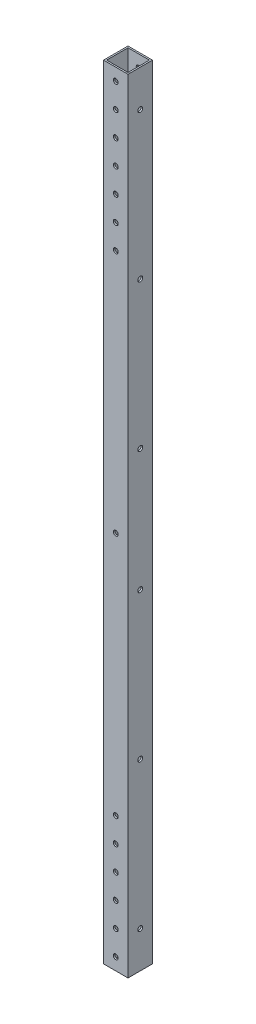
ISO-10303-21;
HEADER;
FILE_DESCRIPTION(('STEP AP214'),'2;1');
FILE_NAME('part.step','',(''),(''),'','','');
FILE_SCHEMA(('AUTOMOTIVE_DESIGN { 1 0 10303 214 1 1 1 1 }'));
ENDSEC;
DATA;
#1=APPLICATION_CONTEXT('core data for automotive mechanical design processes');
#2=APPLICATION_PROTOCOL_DEFINITION('international standard','automotive_design',2000,#1);
#3=PRODUCT_CONTEXT('',#1,'mechanical');
#4=PRODUCT('Part','Part','',(#3));
#5=PRODUCT_RELATED_PRODUCT_CATEGORY('part','',(#4));
#6=PRODUCT_DEFINITION_FORMATION('','',#4);
#7=PRODUCT_DEFINITION_CONTEXT('part definition',#1,'design');
#8=PRODUCT_DEFINITION('design','',#6,#7);
#9=PRODUCT_DEFINITION_SHAPE('','',#8);
#10=(LENGTH_UNIT() NAMED_UNIT(*) SI_UNIT(.MILLI.,.METRE.));
#11=(NAMED_UNIT(*) PLANE_ANGLE_UNIT() SI_UNIT($,.RADIAN.));
#12=(NAMED_UNIT(*) SI_UNIT($,.STERADIAN.) SOLID_ANGLE_UNIT());
#13=UNCERTAINTY_MEASURE_WITH_UNIT(LENGTH_MEASURE(1.E-05),#10,'distance_accuracy_value','');
#14=(GEOMETRIC_REPRESENTATION_CONTEXT(3) GLOBAL_UNCERTAINTY_ASSIGNED_CONTEXT((#13)) GLOBAL_UNIT_ASSIGNED_CONTEXT((#10,
#11,#12)) REPRESENTATION_CONTEXT('',''));
#15=CARTESIAN_POINT('',(0.,0.,0.));
#16=DIRECTION('',(0.,0.,1.));
#17=DIRECTION('',(1.,0.,0.));
#18=AXIS2_PLACEMENT_3D('',#15,#16,#17);
#19=CARTESIAN_POINT('',(-12.7,812.8,12.7));
#20=DIRECTION('',(0.,0.,-1.));
#21=DIRECTION('',(-1.,0.,0.));
#22=AXIS2_PLACEMENT_3D('',#19,#20,#21);
#23=PLANE('',#22);
#24=CARTESIAN_POINT('',(0.,12.7,12.7));
#25=DIRECTION('',(0.,0.,1.));
#26=DIRECTION('',(1.,0.,0.));
#27=AXIS2_PLACEMENT_3D('',#24,#25,#26);
#28=CIRCLE('',#27,2.55269999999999);
#29=CARTESIAN_POINT('',(2.55269999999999,12.7,12.7));
#30=VERTEX_POINT('',#29);
#31=EDGE_CURVE('E266',#30,#30,#28,.T.);
#32=ORIENTED_EDGE('',*,*,#31,.F.);
#33=EDGE_LOOP('',(#32));
#34=FACE_BOUND('',#33,.T.);
#35=CARTESIAN_POINT('',(0.,38.1,12.7));
#36=DIRECTION('',(0.,0.,1.));
#37=DIRECTION('',(1.,0.,0.));
#38=AXIS2_PLACEMENT_3D('',#35,#36,#37);
#39=CIRCLE('',#38,2.55269999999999);
#40=CARTESIAN_POINT('',(2.5526999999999,38.1,12.7));
#41=VERTEX_POINT('',#40);
#42=EDGE_CURVE('E273',#41,#41,#39,.T.);
#43=ORIENTED_EDGE('',*,*,#42,.F.);
#44=EDGE_LOOP('',(#43));
#45=FACE_BOUND('',#44,.T.);
#46=CARTESIAN_POINT('',(-1.74256649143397E-13,63.5,12.7));
#47=DIRECTION('',(0.,0.,1.));
#48=DIRECTION('',(1.,0.,0.));
#49=AXIS2_PLACEMENT_3D('',#46,#47,#48);
#50=CIRCLE('',#49,2.55269999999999);
#51=CARTESIAN_POINT('',(2.55269999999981,63.5,12.7));
#52=VERTEX_POINT('',#51);
#53=EDGE_CURVE('E280',#52,#52,#50,.T.);
#54=ORIENTED_EDGE('',*,*,#53,.F.);
#55=EDGE_LOOP('',(#54));
#56=FACE_BOUND('',#55,.T.);
#57=CARTESIAN_POINT('',(-2.61384973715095E-13,88.9,12.7));
#58=DIRECTION('',(0.,0.,1.));
#59=DIRECTION('',(1.,0.,0.));
#60=AXIS2_PLACEMENT_3D('',#57,#58,#59);
#61=CIRCLE('',#60,2.55269999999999);
#62=CARTESIAN_POINT('',(2.55269999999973,88.9,12.7));
#63=VERTEX_POINT('',#62);
#64=EDGE_CURVE('E287',#63,#63,#61,.T.);
#65=ORIENTED_EDGE('',*,*,#64,.F.);
#66=EDGE_LOOP('',(#65));
#67=FACE_BOUND('',#66,.T.);
#68=CARTESIAN_POINT('',(-3.48513298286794E-13,114.3,12.7));
#69=DIRECTION('',(0.,0.,1.));
#70=DIRECTION('',(1.,0.,0.));
#71=AXIS2_PLACEMENT_3D('',#68,#69,#70);
#72=CIRCLE('',#71,2.55269999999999);
#73=CARTESIAN_POINT('',(2.55269999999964,114.3,12.7));
#74=VERTEX_POINT('',#73);
#75=EDGE_CURVE('E299',#74,#74,#72,.T.);
#76=ORIENTED_EDGE('',*,*,#75,.F.);
#77=EDGE_LOOP('',(#76));
#78=FACE_BOUND('',#77,.T.);
#79=CARTESIAN_POINT('',(-4.35641622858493E-13,139.7,12.7));
#80=DIRECTION('',(0.,0.,1.));
#81=DIRECTION('',(1.,0.,0.));
#82=AXIS2_PLACEMENT_3D('',#79,#80,#81);
#83=CIRCLE('',#82,2.55269999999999);
#84=CARTESIAN_POINT('',(2.55269999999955,139.7,12.7));
#85=VERTEX_POINT('',#84);
#86=EDGE_CURVE('E311',#85,#85,#83,.T.);
#87=ORIENTED_EDGE('',*,*,#86,.F.);
#88=EDGE_LOOP('',(#87));
#89=FACE_BOUND('',#88,.T.);
#90=CARTESIAN_POINT('',(-1.30692486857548E-12,393.7,12.7));
#91=DIRECTION('',(0.,0.,1.));
#92=DIRECTION('',(1.,0.,0.));
#93=AXIS2_PLACEMENT_3D('',#90,#91,#92);
#94=CIRCLE('',#93,2.55269999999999);
#95=CARTESIAN_POINT('',(2.55269999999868,393.7,12.7));
#96=VERTEX_POINT('',#95);
#97=EDGE_CURVE('E318',#96,#96,#94,.T.);
#98=ORIENTED_EDGE('',*,*,#97,.F.);
#99=EDGE_LOOP('',(#98));
#100=FACE_BOUND('',#99,.T.);
#101=CARTESIAN_POINT('',(-2.17820811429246E-12,647.7,12.7));
#102=DIRECTION('',(0.,0.,1.));
#103=DIRECTION('',(1.,0.,0.));
#104=AXIS2_PLACEMENT_3D('',#101,#102,#103);
#105=CIRCLE('',#104,2.55269999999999);
#106=CARTESIAN_POINT('',(2.55269999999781,647.7,12.7));
#107=VERTEX_POINT('',#106);
#108=EDGE_CURVE('E325',#107,#107,#105,.T.);
#109=ORIENTED_EDGE('',*,*,#108,.F.);
#110=EDGE_LOOP('',(#109));
#111=FACE_BOUND('',#110,.T.);
#112=CARTESIAN_POINT('',(-2.26533643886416E-12,673.1,12.7));
#113=DIRECTION('',(0.,0.,1.));
#114=DIRECTION('',(1.,0.,0.));
#115=AXIS2_PLACEMENT_3D('',#112,#113,#114);
#116=CIRCLE('',#115,2.55269999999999);
#117=CARTESIAN_POINT('',(2.55269999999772,673.1,12.7));
#118=VERTEX_POINT('',#117);
#119=EDGE_CURVE('E332',#118,#118,#116,.T.);
#120=ORIENTED_EDGE('',*,*,#119,.F.);
#121=EDGE_LOOP('',(#120));
#122=FACE_BOUND('',#121,.T.);
#123=CARTESIAN_POINT('',(-2.35246476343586E-12,698.5,12.7));
#124=DIRECTION('',(0.,0.,1.));
#125=DIRECTION('',(1.,0.,0.));
#126=AXIS2_PLACEMENT_3D('',#123,#124,#125);
#127=CIRCLE('',#126,2.55269999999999);
#128=CARTESIAN_POINT('',(2.55269999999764,698.5,12.7));
#129=VERTEX_POINT('',#128);
#130=EDGE_CURVE('E339',#129,#129,#127,.T.);
#131=ORIENTED_EDGE('',*,*,#130,.F.);
#132=EDGE_LOOP('',(#131));
#133=FACE_BOUND('',#132,.T.);
#134=CARTESIAN_POINT('',(-2.43959308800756E-12,723.9,12.7));
#135=DIRECTION('',(0.,0.,1.));
#136=DIRECTION('',(1.,0.,0.));
#137=AXIS2_PLACEMENT_3D('',#134,#135,#136);
#138=CIRCLE('',#137,2.55269999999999);
#139=CARTESIAN_POINT('',(2.55269999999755,723.9,12.7));
#140=VERTEX_POINT('',#139);
#141=EDGE_CURVE('E346',#140,#140,#138,.T.);
#142=ORIENTED_EDGE('',*,*,#141,.F.);
#143=EDGE_LOOP('',(#142));
#144=FACE_BOUND('',#143,.T.);
#145=CARTESIAN_POINT('',(-2.52672141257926E-12,749.3,12.7));
#146=DIRECTION('',(0.,0.,1.));
#147=DIRECTION('',(1.,0.,0.));
#148=AXIS2_PLACEMENT_3D('',#145,#146,#147);
#149=CIRCLE('',#148,2.55269999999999);
#150=CARTESIAN_POINT('',(2.55269999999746,749.3,12.7));
#151=VERTEX_POINT('',#150);
#152=EDGE_CURVE('E353',#151,#151,#149,.T.);
#153=ORIENTED_EDGE('',*,*,#152,.F.);
#154=EDGE_LOOP('',(#153));
#155=FACE_BOUND('',#154,.T.);
#156=CARTESIAN_POINT('',(-2.61384973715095E-12,774.7,12.7));
#157=DIRECTION('',(0.,0.,1.));
#158=DIRECTION('',(1.,0.,0.));
#159=AXIS2_PLACEMENT_3D('',#156,#157,#158);
#160=CIRCLE('',#159,2.55269999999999);
#161=CARTESIAN_POINT('',(2.55269999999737,774.7,12.7));
#162=VERTEX_POINT('',#161);
#163=EDGE_CURVE('E360',#162,#162,#160,.T.);
#164=ORIENTED_EDGE('',*,*,#163,.F.);
#165=EDGE_LOOP('',(#164));
#166=FACE_BOUND('',#165,.T.);
#167=DIRECTION('',(1.,0.,0.));
#168=VECTOR('',#167,1.);
#169=CARTESIAN_POINT('',(-12.7,0.,12.7));
#170=LINE('',#169,#168);
#171=CARTESIAN_POINT('',(-12.7,0.,12.7));
#172=VERTEX_POINT('',#171);
#173=CARTESIAN_POINT('',(12.7,0.,12.7));
#174=VERTEX_POINT('',#173);
#175=EDGE_CURVE('E142',#172,#174,#170,.T.);
#176=ORIENTED_EDGE('',*,*,#175,.T.);
#177=DIRECTION('',(0.,-1.,0.));
#178=VECTOR('',#177,1.);
#179=CARTESIAN_POINT('',(12.7,812.8,12.7));
#180=LINE('',#179,#178);
#181=CARTESIAN_POINT('',(12.7,812.8,12.7));
#182=VERTEX_POINT('',#181);
#183=EDGE_CURVE('E148',#182,#174,#180,.T.);
#184=ORIENTED_EDGE('',*,*,#183,.F.);
#185=DIRECTION('',(1.,0.,0.));
#186=VECTOR('',#185,1.);
#187=CARTESIAN_POINT('',(-12.7,812.8,12.7));
#188=LINE('',#187,#186);
#189=CARTESIAN_POINT('',(-12.7,812.8,12.7));
#190=VERTEX_POINT('',#189);
#191=EDGE_CURVE('E146',#190,#182,#188,.T.);
#192=ORIENTED_EDGE('',*,*,#191,.F.);
#193=DIRECTION('',(0.,-1.,0.));
#194=VECTOR('',#193,1.);
#195=CARTESIAN_POINT('',(-12.7,812.8,12.7));
#196=LINE('',#195,#194);
#197=EDGE_CURVE('E158',#190,#172,#196,.T.);
#198=ORIENTED_EDGE('',*,*,#197,.T.);
#199=EDGE_LOOP('',(#176,#184,#192,#198));
#200=FACE_BOUND('',#199,.T.);
#201=CARTESIAN_POINT('',(-2.70097806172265E-12,800.1,12.7));
#202=DIRECTION('',(0.,0.,1.));
#203=DIRECTION('',(1.,0.,0.));
#204=AXIS2_PLACEMENT_3D('',#201,#202,#203);
#205=CIRCLE('',#204,2.55269999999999);
#206=CARTESIAN_POINT('',(2.55269999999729,800.1,12.7));
#207=VERTEX_POINT('',#206);
#208=EDGE_CURVE('E372',#207,#207,#205,.T.);
#209=ORIENTED_EDGE('',*,*,#208,.F.);
#210=EDGE_LOOP('',(#209));
#211=FACE_BOUND('',#210,.T.);
#212=ADVANCED_FACE('F32',(#34,#45,#56,#67,#78,#89,#100,#111,#122,#133,#144,#155,#166,#200,#211),
#23,.F.);
#213=CARTESIAN_POINT('',(0.,812.8,0.));
#214=DIRECTION('',(0.,-1.,0.));
#215=DIRECTION('',(0.,0.,-1.));
#216=AXIS2_PLACEMENT_3D('',#213,#214,#215);
#217=PLANE('',#216);
#218=DIRECTION('',(0.,0.,-1.));
#219=VECTOR('',#218,1.);
#220=CARTESIAN_POINT('',(12.7,812.8,12.7));
#221=LINE('',#220,#219);
#222=CARTESIAN_POINT('',(12.7,812.8,-12.7));
#223=VERTEX_POINT('',#222);
#224=EDGE_CURVE('E138',#182,#223,#221,.T.);
#225=ORIENTED_EDGE('',*,*,#224,.T.);
#226=DIRECTION('',(-1.,0.,0.));
#227=VECTOR('',#226,1.);
#228=CARTESIAN_POINT('',(-12.7,812.8,-12.7));
#229=LINE('',#228,#227);
#230=CARTESIAN_POINT('',(-12.7,812.8,-12.7));
#231=VERTEX_POINT('',#230);
#232=EDGE_CURVE('E141',#223,#231,#229,.T.);
#233=ORIENTED_EDGE('',*,*,#232,.T.);
#234=DIRECTION('',(0.,0.,1.));
#235=VECTOR('',#234,1.);
#236=CARTESIAN_POINT('',(-12.7,812.8,12.7));
#237=LINE('',#236,#235);
#238=EDGE_CURVE('E144',#231,#190,#237,.T.);
#239=ORIENTED_EDGE('',*,*,#238,.T.);
#240=ORIENTED_EDGE('',*,*,#191,.T.);
#241=EDGE_LOOP('',(#225,#233,#239,#240));
#242=FACE_BOUND('',#241,.T.);
#243=DIRECTION('',(0.,0.,-1.));
#244=VECTOR('',#243,1.);
#245=CARTESIAN_POINT('',(11.1125,812.8,11.1125));
#246=LINE('',#245,#244);
#247=CARTESIAN_POINT('',(11.1125,812.8,11.1125));
#248=VERTEX_POINT('',#247);
#249=CARTESIAN_POINT('',(11.1125,812.8,-11.1125));
#250=VERTEX_POINT('',#249);
#251=EDGE_CURVE('E99',#248,#250,#246,.T.);
#252=ORIENTED_EDGE('',*,*,#251,.F.);
#253=DIRECTION('',(1.,0.,0.));
#254=VECTOR('',#253,1.);
#255=CARTESIAN_POINT('',(-11.1125,812.8,11.1125));
#256=LINE('',#255,#254);
#257=CARTESIAN_POINT('',(-11.1125,812.8,11.1125));
#258=VERTEX_POINT('',#257);
#259=EDGE_CURVE('E122',#258,#248,#256,.T.);
#260=ORIENTED_EDGE('',*,*,#259,.F.);
#261=DIRECTION('',(0.,0.,1.));
#262=VECTOR('',#261,1.);
#263=CARTESIAN_POINT('',(-11.1125,812.8,11.1125));
#264=LINE('',#263,#262);
#265=CARTESIAN_POINT('',(-11.1125,812.8,-11.1125));
#266=VERTEX_POINT('',#265);
#267=EDGE_CURVE('E120',#266,#258,#264,.T.);
#268=ORIENTED_EDGE('',*,*,#267,.F.);
#269=DIRECTION('',(-1.,0.,0.));
#270=VECTOR('',#269,1.);
#271=CARTESIAN_POINT('',(-11.1125,812.8,-11.1125));
#272=LINE('',#271,#270);
#273=EDGE_CURVE('E107',#250,#266,#272,.T.);
#274=ORIENTED_EDGE('',*,*,#273,.F.);
#275=EDGE_LOOP('',(#252,#260,#268,#274));
#276=FACE_BOUND('',#275,.T.);
#277=ADVANCED_FACE('F119',(#242,#276),#217,.F.);
#278=CARTESIAN_POINT('',(0.,0.,0.));
#279=DIRECTION('',(0.,-1.,0.));
#280=DIRECTION('',(0.,0.,-1.));
#281=AXIS2_PLACEMENT_3D('',#278,#279,#280);
#282=PLANE('',#281);
#283=DIRECTION('',(0.,0.,-1.));
#284=VECTOR('',#283,1.);
#285=CARTESIAN_POINT('',(12.7,0.,12.7));
#286=LINE('',#285,#284);
#287=CARTESIAN_POINT('',(12.7,0.,-12.7));
#288=VERTEX_POINT('',#287);
#289=EDGE_CURVE('E115',#174,#288,#286,.T.);
#290=ORIENTED_EDGE('',*,*,#289,.F.);
#291=ORIENTED_EDGE('',*,*,#175,.F.);
#292=DIRECTION('',(0.,0.,1.));
#293=VECTOR('',#292,1.);
#294=CARTESIAN_POINT('',(-12.7,0.,12.7));
#295=LINE('',#294,#293);
#296=CARTESIAN_POINT('',(-12.7,0.,-12.7));
#297=VERTEX_POINT('',#296);
#298=EDGE_CURVE('E153',#297,#172,#295,.T.);
#299=ORIENTED_EDGE('',*,*,#298,.F.);
#300=DIRECTION('',(-1.,0.,0.));
#301=VECTOR('',#300,1.);
#302=CARTESIAN_POINT('',(-12.7,0.,-12.7));
#303=LINE('',#302,#301);
#304=EDGE_CURVE('E151',#288,#297,#303,.T.);
#305=ORIENTED_EDGE('',*,*,#304,.F.);
#306=EDGE_LOOP('',(#290,#291,#299,#305));
#307=FACE_BOUND('',#306,.T.);
#308=DIRECTION('',(1.,0.,0.));
#309=VECTOR('',#308,1.);
#310=CARTESIAN_POINT('',(-11.1125,0.,11.1125));
#311=LINE('',#310,#309);
#312=CARTESIAN_POINT('',(-11.1125,0.,11.1125));
#313=VERTEX_POINT('',#312);
#314=CARTESIAN_POINT('',(11.1125,0.,11.1125));
#315=VERTEX_POINT('',#314);
#316=EDGE_CURVE('E108',#313,#315,#311,.T.);
#317=ORIENTED_EDGE('',*,*,#316,.T.);
#318=DIRECTION('',(0.,0.,-1.));
#319=VECTOR('',#318,1.);
#320=CARTESIAN_POINT('',(11.1125,0.,11.1125));
#321=LINE('',#320,#319);
#322=CARTESIAN_POINT('',(11.1125,0.,-11.1125));
#323=VERTEX_POINT('',#322);
#324=EDGE_CURVE('E57',#315,#323,#321,.T.);
#325=ORIENTED_EDGE('',*,*,#324,.T.);
#326=DIRECTION('',(-1.,0.,0.));
#327=VECTOR('',#326,1.);
#328=CARTESIAN_POINT('',(-11.1125,0.,-11.1125));
#329=LINE('',#328,#327);
#330=CARTESIAN_POINT('',(-11.1125,0.,-11.1125));
#331=VERTEX_POINT('',#330);
#332=EDGE_CURVE('E114',#323,#331,#329,.T.);
#333=ORIENTED_EDGE('',*,*,#332,.T.);
#334=DIRECTION('',(0.,0.,1.));
#335=VECTOR('',#334,1.);
#336=CARTESIAN_POINT('',(-11.1125,0.,11.1125));
#337=LINE('',#336,#335);
#338=EDGE_CURVE('E130',#331,#313,#337,.T.);
#339=ORIENTED_EDGE('',*,*,#338,.T.);
#340=EDGE_LOOP('',(#317,#325,#333,#339));
#341=FACE_BOUND('',#340,.T.);
#342=ADVANCED_FACE('F408',(#307,#341),#282,.T.);
#343=CARTESIAN_POINT('',(12.7,812.8,12.7));
#344=DIRECTION('',(-1.,0.,0.));
#345=DIRECTION('',(0.,0.,1.));
#346=AXIS2_PLACEMENT_3D('',#343,#344,#345);
#347=PLANE('',#346);
#348=CARTESIAN_POINT('',(12.7,38.1,0.));
#349=DIRECTION('',(1.,0.,0.));
#350=DIRECTION('',(0.,0.,-1.));
#351=AXIS2_PLACEMENT_3D('',#348,#349,#350);
#352=CIRCLE('',#351,2.55269999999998);
#353=CARTESIAN_POINT('',(12.7,38.1,-2.55269999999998));
#354=VERTEX_POINT('',#353);
#355=EDGE_CURVE('E587',#354,#354,#352,.T.);
#356=ORIENTED_EDGE('',*,*,#355,.F.);
#357=EDGE_LOOP('',(#356));
#358=FACE_BOUND('',#357,.T.);
#359=CARTESIAN_POINT('',(12.7,190.5,5.22769947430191E-13));
#360=DIRECTION('',(1.,0.,0.));
#361=DIRECTION('',(0.,0.,-1.));
#362=AXIS2_PLACEMENT_3D('',#359,#360,#361);
#363=CIRCLE('',#362,2.55269999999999);
#364=CARTESIAN_POINT('',(12.7,190.5,-2.55269999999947));
#365=VERTEX_POINT('',#364);
#366=EDGE_CURVE('E596',#365,#365,#363,.T.);
#367=ORIENTED_EDGE('',*,*,#366,.F.);
#368=EDGE_LOOP('',(#367));
#369=FACE_BOUND('',#368,.T.);
#370=CARTESIAN_POINT('',(12.7,342.9,1.04553989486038E-12));
#371=DIRECTION('',(1.,0.,0.));
#372=DIRECTION('',(0.,0.,-1.));
#373=AXIS2_PLACEMENT_3D('',#370,#371,#372);
#374=CIRCLE('',#373,2.55269999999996);
#375=CARTESIAN_POINT('',(12.7,342.9,-2.55269999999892));
#376=VERTEX_POINT('',#375);
#377=EDGE_CURVE('E227',#376,#376,#374,.T.);
#378=ORIENTED_EDGE('',*,*,#377,.F.);
#379=EDGE_LOOP('',(#378));
#380=FACE_BOUND('',#379,.T.);
#381=CARTESIAN_POINT('',(12.7,469.9,1.48118151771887E-12));
#382=DIRECTION('',(1.,0.,0.));
#383=DIRECTION('',(0.,0.,-1.));
#384=AXIS2_PLACEMENT_3D('',#381,#382,#383);
#385=CIRCLE('',#384,2.55269999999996);
#386=CARTESIAN_POINT('',(12.7,469.9,-2.55269999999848));
#387=VERTEX_POINT('',#386);
#388=EDGE_CURVE('E224',#387,#387,#385,.T.);
#389=ORIENTED_EDGE('',*,*,#388,.F.);
#390=EDGE_LOOP('',(#389));
#391=FACE_BOUND('',#390,.T.);
#392=CARTESIAN_POINT('',(12.7,622.3,2.00395146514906E-12));
#393=DIRECTION('',(1.,0.,0.));
#394=DIRECTION('',(0.,0.,-1.));
#395=AXIS2_PLACEMENT_3D('',#392,#393,#394);
#396=CIRCLE('',#395,2.55269999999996);
#397=CARTESIAN_POINT('',(12.7,622.3,-2.55269999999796));
#398=VERTEX_POINT('',#397);
#399=EDGE_CURVE('E242',#398,#398,#396,.T.);
#400=ORIENTED_EDGE('',*,*,#399,.F.);
#401=EDGE_LOOP('',(#400));
#402=FACE_BOUND('',#401,.T.);
#403=CARTESIAN_POINT('',(12.7,774.7,2.52672141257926E-12));
#404=DIRECTION('',(1.,0.,0.));
#405=DIRECTION('',(0.,0.,-1.));
#406=AXIS2_PLACEMENT_3D('',#403,#404,#405);
#407=CIRCLE('',#406,2.55269999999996);
#408=CARTESIAN_POINT('',(12.7,774.7,-2.55269999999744));
#409=VERTEX_POINT('',#408);
#410=EDGE_CURVE('E254',#409,#409,#407,.T.);
#411=ORIENTED_EDGE('',*,*,#410,.F.);
#412=EDGE_LOOP('',(#411));
#413=FACE_BOUND('',#412,.T.);
#414=ORIENTED_EDGE('',*,*,#289,.T.);
#415=DIRECTION('',(0.,-1.,0.));
#416=VECTOR('',#415,1.);
#417=CARTESIAN_POINT('',(12.7,812.8,-12.7));
#418=LINE('',#417,#416);
#419=EDGE_CURVE('E11',#223,#288,#418,.T.);
#420=ORIENTED_EDGE('',*,*,#419,.F.);
#421=ORIENTED_EDGE('',*,*,#224,.F.);
#422=ORIENTED_EDGE('',*,*,#183,.T.);
#423=EDGE_LOOP('',(#414,#420,#421,#422));
#424=FACE_BOUND('',#423,.T.);
#425=ADVANCED_FACE('F34',(#358,#369,#380,#391,#402,#413,#424),#347,.F.);
#426=CARTESIAN_POINT('',(-12.7,812.8,-12.7));
#427=DIRECTION('',(0.,0.,1.));
#428=DIRECTION('',(1.,0.,0.));
#429=AXIS2_PLACEMENT_3D('',#426,#427,#428);
#430=PLANE('',#429);
#431=CARTESIAN_POINT('',(0.,12.7,-12.7));
#432=DIRECTION('',(0.,0.,1.));
#433=DIRECTION('',(1.,0.,0.));
#434=AXIS2_PLACEMENT_3D('',#431,#432,#433);
#435=CIRCLE('',#434,2.55269999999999);
#436=CARTESIAN_POINT('',(2.55269999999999,12.7,-12.7));
#437=VERTEX_POINT('',#436);
#438=EDGE_CURVE('E212',#437,#437,#435,.T.);
#439=ORIENTED_EDGE('',*,*,#438,.T.);
#440=EDGE_LOOP('',(#439));
#441=FACE_BOUND('',#440,.T.);
#442=CARTESIAN_POINT('',(0.,38.1,-12.7));
#443=DIRECTION('',(0.,0.,1.));
#444=DIRECTION('',(1.,0.,0.));
#445=AXIS2_PLACEMENT_3D('',#442,#443,#444);
#446=CIRCLE('',#445,2.55269999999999);
#447=CARTESIAN_POINT('',(2.55269999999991,38.1,-12.7));
#448=VERTEX_POINT('',#447);
#449=EDGE_CURVE('E207',#448,#448,#446,.T.);
#450=ORIENTED_EDGE('',*,*,#449,.T.);
#451=EDGE_LOOP('',(#450));
#452=FACE_BOUND('',#451,.T.);
#453=CARTESIAN_POINT('',(-1.74256649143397E-13,63.5,-12.7));
#454=DIRECTION('',(0.,0.,1.));
#455=DIRECTION('',(1.,0.,0.));
#456=AXIS2_PLACEMENT_3D('',#453,#454,#455);
#457=CIRCLE('',#456,2.55269999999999);
#458=CARTESIAN_POINT('',(2.55269999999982,63.5,-12.7));
#459=VERTEX_POINT('',#458);
#460=EDGE_CURVE('E202',#459,#459,#457,.T.);
#461=ORIENTED_EDGE('',*,*,#460,.T.);
#462=EDGE_LOOP('',(#461));
#463=FACE_BOUND('',#462,.T.);
#464=CARTESIAN_POINT('',(-2.61384973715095E-13,88.9,-12.7));
#465=DIRECTION('',(0.,0.,1.));
#466=DIRECTION('',(1.,0.,0.));
#467=AXIS2_PLACEMENT_3D('',#464,#465,#466);
#468=CIRCLE('',#467,2.55269999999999);
#469=CARTESIAN_POINT('',(2.55269999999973,88.9,-12.7));
#470=VERTEX_POINT('',#469);
#471=EDGE_CURVE('E290',#470,#470,#468,.T.);
#472=ORIENTED_EDGE('',*,*,#471,.T.);
#473=EDGE_LOOP('',(#472));
#474=FACE_BOUND('',#473,.T.);
#475=CARTESIAN_POINT('',(-3.48513298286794E-13,114.3,-12.7));
#476=DIRECTION('',(0.,0.,1.));
#477=DIRECTION('',(1.,0.,0.));
#478=AXIS2_PLACEMENT_3D('',#475,#476,#477);
#479=CIRCLE('',#478,2.55269999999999);
#480=CARTESIAN_POINT('',(2.55269999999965,114.3,-12.7));
#481=VERTEX_POINT('',#480);
#482=EDGE_CURVE('E302',#481,#481,#479,.T.);
#483=ORIENTED_EDGE('',*,*,#482,.T.);
#484=EDGE_LOOP('',(#483));
#485=FACE_BOUND('',#484,.T.);
#486=CARTESIAN_POINT('',(-4.35641622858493E-13,139.7,-12.7));
#487=DIRECTION('',(0.,0.,1.));
#488=DIRECTION('',(1.,0.,0.));
#489=AXIS2_PLACEMENT_3D('',#486,#487,#488);
#490=CIRCLE('',#489,2.55269999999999);
#491=CARTESIAN_POINT('',(2.55269999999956,139.7,-12.7));
#492=VERTEX_POINT('',#491);
#493=EDGE_CURVE('E197',#492,#492,#490,.T.);
#494=ORIENTED_EDGE('',*,*,#493,.T.);
#495=EDGE_LOOP('',(#494));
#496=FACE_BOUND('',#495,.T.);
#497=CARTESIAN_POINT('',(-1.30692486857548E-12,393.7,-12.7));
#498=DIRECTION('',(0.,0.,1.));
#499=DIRECTION('',(1.,0.,0.));
#500=AXIS2_PLACEMENT_3D('',#497,#498,#499);
#501=CIRCLE('',#500,2.55269999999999);
#502=CARTESIAN_POINT('',(2.55269999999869,393.7,-12.7));
#503=VERTEX_POINT('',#502);
#504=EDGE_CURVE('E192',#503,#503,#501,.T.);
#505=ORIENTED_EDGE('',*,*,#504,.T.);
#506=EDGE_LOOP('',(#505));
#507=FACE_BOUND('',#506,.T.);
#508=CARTESIAN_POINT('',(-2.17820811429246E-12,647.7,-12.7));
#509=DIRECTION('',(0.,0.,1.));
#510=DIRECTION('',(1.,0.,0.));
#511=AXIS2_PLACEMENT_3D('',#508,#509,#510);
#512=CIRCLE('',#511,2.55269999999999);
#513=CARTESIAN_POINT('',(2.55269999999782,647.7,-12.7));
#514=VERTEX_POINT('',#513);
#515=EDGE_CURVE('E187',#514,#514,#512,.T.);
#516=ORIENTED_EDGE('',*,*,#515,.T.);
#517=EDGE_LOOP('',(#516));
#518=FACE_BOUND('',#517,.T.);
#519=CARTESIAN_POINT('',(-2.26533643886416E-12,673.1,-12.7));
#520=DIRECTION('',(0.,0.,1.));
#521=DIRECTION('',(1.,0.,0.));
#522=AXIS2_PLACEMENT_3D('',#519,#520,#521);
#523=CIRCLE('',#522,2.55269999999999);
#524=CARTESIAN_POINT('',(2.55269999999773,673.1,-12.7));
#525=VERTEX_POINT('',#524);
#526=EDGE_CURVE('E182',#525,#525,#523,.T.);
#527=ORIENTED_EDGE('',*,*,#526,.T.);
#528=EDGE_LOOP('',(#527));
#529=FACE_BOUND('',#528,.T.);
#530=CARTESIAN_POINT('',(-2.35246476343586E-12,698.5,-12.7));
#531=DIRECTION('',(0.,0.,1.));
#532=DIRECTION('',(1.,0.,0.));
#533=AXIS2_PLACEMENT_3D('',#530,#531,#532);
#534=CIRCLE('',#533,2.55269999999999);
#535=CARTESIAN_POINT('',(2.55269999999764,698.5,-12.7));
#536=VERTEX_POINT('',#535);
#537=EDGE_CURVE('E177',#536,#536,#534,.T.);
#538=ORIENTED_EDGE('',*,*,#537,.T.);
#539=EDGE_LOOP('',(#538));
#540=FACE_BOUND('',#539,.T.);
#541=CARTESIAN_POINT('',(-2.43959308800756E-12,723.9,-12.7));
#542=DIRECTION('',(0.,0.,1.));
#543=DIRECTION('',(1.,0.,0.));
#544=AXIS2_PLACEMENT_3D('',#541,#542,#543);
#545=CIRCLE('',#544,2.55269999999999);
#546=CARTESIAN_POINT('',(2.55269999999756,723.9,-12.7));
#547=VERTEX_POINT('',#546);
#548=EDGE_CURVE('E172',#547,#547,#545,.T.);
#549=ORIENTED_EDGE('',*,*,#548,.T.);
#550=EDGE_LOOP('',(#549));
#551=FACE_BOUND('',#550,.T.);
#552=CARTESIAN_POINT('',(-2.52672141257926E-12,749.3,-12.7));
#553=DIRECTION('',(0.,0.,1.));
#554=DIRECTION('',(1.,0.,0.));
#555=AXIS2_PLACEMENT_3D('',#552,#553,#554);
#556=CIRCLE('',#555,2.55269999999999);
#557=CARTESIAN_POINT('',(2.55269999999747,749.3,-12.7));
#558=VERTEX_POINT('',#557);
#559=EDGE_CURVE('E167',#558,#558,#556,.T.);
#560=ORIENTED_EDGE('',*,*,#559,.T.);
#561=EDGE_LOOP('',(#560));
#562=FACE_BOUND('',#561,.T.);
#563=CARTESIAN_POINT('',(-2.61384973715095E-12,774.7,-12.7));
#564=DIRECTION('',(0.,0.,1.));
#565=DIRECTION('',(1.,0.,0.));
#566=AXIS2_PLACEMENT_3D('',#563,#564,#565);
#567=CIRCLE('',#566,2.55269999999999);
#568=CARTESIAN_POINT('',(2.55269999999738,774.7,-12.7));
#569=VERTEX_POINT('',#568);
#570=EDGE_CURVE('E363',#569,#569,#567,.T.);
#571=ORIENTED_EDGE('',*,*,#570,.T.);
#572=EDGE_LOOP('',(#571));
#573=FACE_BOUND('',#572,.T.);
#574=CARTESIAN_POINT('',(-2.70097806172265E-12,800.1,-12.7));
#575=DIRECTION('',(0.,0.,1.));
#576=DIRECTION('',(1.,0.,0.));
#577=AXIS2_PLACEMENT_3D('',#574,#575,#576);
#578=CIRCLE('',#577,2.55269999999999);
#579=CARTESIAN_POINT('',(2.55269999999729,800.1,-12.7));
#580=VERTEX_POINT('',#579);
#581=EDGE_CURVE('E375',#580,#580,#578,.T.);
#582=ORIENTED_EDGE('',*,*,#581,.T.);
#583=EDGE_LOOP('',(#582));
#584=FACE_BOUND('',#583,.T.);
#585=ORIENTED_EDGE('',*,*,#304,.T.);
#586=DIRECTION('',(0.,-1.,0.));
#587=VECTOR('',#586,1.);
#588=CARTESIAN_POINT('',(-12.7,812.8,-12.7));
#589=LINE('',#588,#587);
#590=EDGE_CURVE('E41',#231,#297,#589,.T.);
#591=ORIENTED_EDGE('',*,*,#590,.F.);
#592=ORIENTED_EDGE('',*,*,#232,.F.);
#593=ORIENTED_EDGE('',*,*,#419,.T.);
#594=EDGE_LOOP('',(#585,#591,#592,#593));
#595=FACE_BOUND('',#594,.T.);
#596=ADVANCED_FACE('F416',(#441,#452,#463,#474,#485,#496,#507,#518,#529,#540,#551,#562,#573,
#584,#595),#430,.F.);
#597=CARTESIAN_POINT('',(-12.7,812.8,12.7));
#598=DIRECTION('',(1.,0.,0.));
#599=DIRECTION('',(0.,0.,-1.));
#600=AXIS2_PLACEMENT_3D('',#597,#598,#599);
#601=PLANE('',#600);
#602=CARTESIAN_POINT('',(-12.7,38.1,0.));
#603=DIRECTION('',(1.,0.,0.));
#604=DIRECTION('',(0.,0.,-1.));
#605=AXIS2_PLACEMENT_3D('',#602,#603,#604);
#606=CIRCLE('',#605,2.5527);
#607=CARTESIAN_POINT('',(-12.7,38.1,-2.5527));
#608=VERTEX_POINT('',#607);
#609=EDGE_CURVE('E586',#608,#608,#606,.T.);
#610=ORIENTED_EDGE('',*,*,#609,.T.);
#611=EDGE_LOOP('',(#610));
#612=FACE_BOUND('',#611,.T.);
#613=CARTESIAN_POINT('',(-12.7,190.5,5.22769947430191E-13));
#614=DIRECTION('',(1.,0.,0.));
#615=DIRECTION('',(0.,0.,-1.));
#616=AXIS2_PLACEMENT_3D('',#613,#614,#615);
#617=CIRCLE('',#616,2.55269999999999);
#618=CARTESIAN_POINT('',(-12.7,190.5,-2.55269999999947));
#619=VERTEX_POINT('',#618);
#620=EDGE_CURVE('E599',#619,#619,#617,.T.);
#621=ORIENTED_EDGE('',*,*,#620,.T.);
#622=EDGE_LOOP('',(#621));
#623=FACE_BOUND('',#622,.T.);
#624=CARTESIAN_POINT('',(-12.7,342.9,1.04553989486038E-12));
#625=DIRECTION('',(1.,0.,0.));
#626=DIRECTION('',(0.,0.,-1.));
#627=AXIS2_PLACEMENT_3D('',#624,#625,#626);
#628=CIRCLE('',#627,2.55270000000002);
#629=CARTESIAN_POINT('',(-12.7,342.9,-2.55269999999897));
#630=VERTEX_POINT('',#629);
#631=EDGE_CURVE('E220',#630,#630,#628,.T.);
#632=ORIENTED_EDGE('',*,*,#631,.T.);
#633=EDGE_LOOP('',(#632));
#634=FACE_BOUND('',#633,.T.);
#635=CARTESIAN_POINT('',(-12.7,469.9,1.48118151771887E-12));
#636=DIRECTION('',(1.,0.,0.));
#637=DIRECTION('',(0.,0.,-1.));
#638=AXIS2_PLACEMENT_3D('',#635,#636,#637);
#639=CIRCLE('',#638,2.55270000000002);
#640=CARTESIAN_POINT('',(-12.7,469.9,-2.55269999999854));
#641=VERTEX_POINT('',#640);
#642=EDGE_CURVE('E216',#641,#641,#639,.T.);
#643=ORIENTED_EDGE('',*,*,#642,.T.);
#644=EDGE_LOOP('',(#643));
#645=FACE_BOUND('',#644,.T.);
#646=CARTESIAN_POINT('',(-12.7,622.3,2.00395146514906E-12));
#647=DIRECTION('',(1.,0.,0.));
#648=DIRECTION('',(0.,0.,-1.));
#649=AXIS2_PLACEMENT_3D('',#646,#647,#648);
#650=CIRCLE('',#649,2.55269999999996);
#651=CARTESIAN_POINT('',(-12.7,622.3,-2.55269999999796));
#652=VERTEX_POINT('',#651);
#653=EDGE_CURVE('E245',#652,#652,#650,.T.);
#654=ORIENTED_EDGE('',*,*,#653,.T.);
#655=EDGE_LOOP('',(#654));
#656=FACE_BOUND('',#655,.T.);
#657=CARTESIAN_POINT('',(-12.7,774.7,2.52672141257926E-12));
#658=DIRECTION('',(1.,0.,0.));
#659=DIRECTION('',(0.,0.,-1.));
#660=AXIS2_PLACEMENT_3D('',#657,#658,#659);
#661=CIRCLE('',#660,2.55269999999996);
#662=CARTESIAN_POINT('',(-12.7,774.7,-2.55269999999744));
#663=VERTEX_POINT('',#662);
#664=EDGE_CURVE('E257',#663,#663,#661,.T.);
#665=ORIENTED_EDGE('',*,*,#664,.T.);
#666=EDGE_LOOP('',(#665));
#667=FACE_BOUND('',#666,.T.);
#668=ORIENTED_EDGE('',*,*,#298,.T.);
#669=ORIENTED_EDGE('',*,*,#197,.F.);
#670=ORIENTED_EDGE('',*,*,#238,.F.);
#671=ORIENTED_EDGE('',*,*,#590,.T.);
#672=EDGE_LOOP('',(#668,#669,#670,#671));
#673=FACE_BOUND('',#672,.T.);
#674=ADVANCED_FACE('F397',(#612,#623,#634,#645,#656,#667,#673),#601,.F.);
#675=CARTESIAN_POINT('',(11.1125,812.8,11.1125));
#676=DIRECTION('',(-1.,0.,0.));
#677=DIRECTION('',(0.,0.,1.));
#678=AXIS2_PLACEMENT_3D('',#675,#676,#677);
#679=PLANE('',#678);
#680=CARTESIAN_POINT('',(11.1125,38.1,0.));
#681=DIRECTION('',(-1.,0.,0.));
#682=DIRECTION('',(0.,0.,1.));
#683=AXIS2_PLACEMENT_3D('',#680,#681,#682);
#684=CIRCLE('',#683,2.55269999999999);
#685=CARTESIAN_POINT('',(11.1125,38.1,2.55269999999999));
#686=VERTEX_POINT('',#685);
#687=EDGE_CURVE('E589',#686,#686,#684,.T.);
#688=ORIENTED_EDGE('',*,*,#687,.F.);
#689=EDGE_LOOP('',(#688));
#690=FACE_BOUND('',#689,.T.);
#691=CARTESIAN_POINT('',(11.1125,190.5,5.22769947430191E-13));
#692=DIRECTION('',(-1.,0.,0.));
#693=DIRECTION('',(0.,0.,1.));
#694=AXIS2_PLACEMENT_3D('',#691,#692,#693);
#695=CIRCLE('',#694,2.55269999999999);
#696=CARTESIAN_POINT('',(11.1125,190.5,2.55270000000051));
#697=VERTEX_POINT('',#696);
#698=EDGE_CURVE('E36',#697,#697,#695,.T.);
#699=ORIENTED_EDGE('',*,*,#698,.F.);
#700=EDGE_LOOP('',(#699));
#701=FACE_BOUND('',#700,.T.);
#702=CARTESIAN_POINT('',(11.1125,342.9,1.04553989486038E-12));
#703=DIRECTION('',(-1.,0.,0.));
#704=DIRECTION('',(0.,0.,1.));
#705=AXIS2_PLACEMENT_3D('',#702,#703,#704);
#706=CIRCLE('',#705,2.55269999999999);
#707=CARTESIAN_POINT('',(11.1125,342.9,2.55270000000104));
#708=VERTEX_POINT('',#707);
#709=EDGE_CURVE('E217',#708,#708,#706,.T.);
#710=ORIENTED_EDGE('',*,*,#709,.F.);
#711=EDGE_LOOP('',(#710));
#712=FACE_BOUND('',#711,.T.);
#713=CARTESIAN_POINT('',(11.1125,469.9,1.48118151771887E-12));
#714=DIRECTION('',(-1.,0.,0.));
#715=DIRECTION('',(0.,0.,1.));
#716=AXIS2_PLACEMENT_3D('',#713,#714,#715);
#717=CIRCLE('',#716,2.55269999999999);
#718=CARTESIAN_POINT('',(11.1125,469.9,2.55270000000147));
#719=VERTEX_POINT('',#718);
#720=EDGE_CURVE('E215',#719,#719,#717,.T.);
#721=ORIENTED_EDGE('',*,*,#720,.F.);
#722=EDGE_LOOP('',(#721));
#723=FACE_BOUND('',#722,.T.);
#724=CARTESIAN_POINT('',(11.1125,622.3,2.00395146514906E-12));
#725=DIRECTION('',(-1.,0.,0.));
#726=DIRECTION('',(0.,0.,1.));
#727=AXIS2_PLACEMENT_3D('',#724,#725,#726);
#728=CIRCLE('',#727,2.55269999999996);
#729=CARTESIAN_POINT('',(11.1125,622.3,2.55270000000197));
#730=VERTEX_POINT('',#729);
#731=EDGE_CURVE('E251',#730,#730,#728,.T.);
#732=ORIENTED_EDGE('',*,*,#731,.F.);
#733=EDGE_LOOP('',(#732));
#734=FACE_BOUND('',#733,.T.);
#735=CARTESIAN_POINT('',(11.1125,774.7,2.52672141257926E-12));
#736=DIRECTION('',(-1.,0.,0.));
#737=DIRECTION('',(0.,0.,1.));
#738=AXIS2_PLACEMENT_3D('',#735,#736,#737);
#739=CIRCLE('',#738,2.55269999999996);
#740=CARTESIAN_POINT('',(11.1125,774.7,2.55270000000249));
#741=VERTEX_POINT('',#740);
#742=EDGE_CURVE('E260',#741,#741,#739,.T.);
#743=ORIENTED_EDGE('',*,*,#742,.F.);
#744=EDGE_LOOP('',(#743));
#745=FACE_BOUND('',#744,.T.);
#746=ORIENTED_EDGE('',*,*,#324,.F.);
#747=DIRECTION('',(0.,-1.,0.));
#748=VECTOR('',#747,1.);
#749=CARTESIAN_POINT('',(11.1125,812.8,11.1125));
#750=LINE('',#749,#748);
#751=EDGE_CURVE('E103',#248,#315,#750,.T.);
#752=ORIENTED_EDGE('',*,*,#751,.F.);
#753=ORIENTED_EDGE('',*,*,#251,.T.);
#754=DIRECTION('',(0.,-1.,0.));
#755=VECTOR('',#754,1.);
#756=CARTESIAN_POINT('',(11.1125,812.8,-11.1125));
#757=LINE('',#756,#755);
#758=EDGE_CURVE('E102',#250,#323,#757,.T.);
#759=ORIENTED_EDGE('',*,*,#758,.T.);
#760=EDGE_LOOP('',(#746,#752,#753,#759));
#761=FACE_BOUND('',#760,.T.);
#762=ADVANCED_FACE('F101',(#690,#701,#712,#723,#734,#745,#761),#679,.T.);
#763=CARTESIAN_POINT('',(-11.1125,812.8,-11.1125));
#764=DIRECTION('',(0.,0.,1.));
#765=DIRECTION('',(1.,0.,0.));
#766=AXIS2_PLACEMENT_3D('',#763,#764,#765);
#767=PLANE('',#766);
#768=CARTESIAN_POINT('',(0.,12.7,-11.1125));
#769=DIRECTION('',(0.,0.,1.));
#770=DIRECTION('',(1.,0.,0.));
#771=AXIS2_PLACEMENT_3D('',#768,#769,#770);
#772=CIRCLE('',#771,2.55269999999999);
#773=CARTESIAN_POINT('',(2.55269999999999,12.7,-11.1125));
#774=VERTEX_POINT('',#773);
#775=EDGE_CURVE('E208',#774,#774,#772,.T.);
#776=ORIENTED_EDGE('',*,*,#775,.F.);
#777=EDGE_LOOP('',(#776));
#778=FACE_BOUND('',#777,.T.);
#779=CARTESIAN_POINT('',(0.,38.1,-11.1125));
#780=DIRECTION('',(0.,0.,1.));
#781=DIRECTION('',(1.,0.,0.));
#782=AXIS2_PLACEMENT_3D('',#779,#780,#781);
#783=CIRCLE('',#782,2.55269999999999);
#784=CARTESIAN_POINT('',(2.5526999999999,38.1,-11.1125));
#785=VERTEX_POINT('',#784);
#786=EDGE_CURVE('E206',#785,#785,#783,.T.);
#787=ORIENTED_EDGE('',*,*,#786,.F.);
#788=EDGE_LOOP('',(#787));
#789=FACE_BOUND('',#788,.T.);
#790=CARTESIAN_POINT('',(-1.74256649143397E-13,63.5,-11.1125));
#791=DIRECTION('',(0.,0.,1.));
#792=DIRECTION('',(1.,0.,0.));
#793=AXIS2_PLACEMENT_3D('',#790,#791,#792);
#794=CIRCLE('',#793,2.55269999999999);
#795=CARTESIAN_POINT('',(2.55269999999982,63.5,-11.1125));
#796=VERTEX_POINT('',#795);
#797=EDGE_CURVE('E198',#796,#796,#794,.T.);
#798=ORIENTED_EDGE('',*,*,#797,.F.);
#799=EDGE_LOOP('',(#798));
#800=FACE_BOUND('',#799,.T.);
#801=CARTESIAN_POINT('',(-2.61384973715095E-13,88.9,-11.1125));
#802=DIRECTION('',(0.,0.,1.));
#803=DIRECTION('',(1.,0.,0.));
#804=AXIS2_PLACEMENT_3D('',#801,#802,#803);
#805=CIRCLE('',#804,2.55269999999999);
#806=CARTESIAN_POINT('',(2.55269999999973,88.9,-11.1125));
#807=VERTEX_POINT('',#806);
#808=EDGE_CURVE('E296',#807,#807,#805,.T.);
#809=ORIENTED_EDGE('',*,*,#808,.F.);
#810=EDGE_LOOP('',(#809));
#811=FACE_BOUND('',#810,.T.);
#812=CARTESIAN_POINT('',(-3.48513298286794E-13,114.3,-11.1125));
#813=DIRECTION('',(0.,0.,1.));
#814=DIRECTION('',(1.,0.,0.));
#815=AXIS2_PLACEMENT_3D('',#812,#813,#814);
#816=CIRCLE('',#815,2.55269999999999);
#817=CARTESIAN_POINT('',(2.55269999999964,114.3,-11.1125));
#818=VERTEX_POINT('',#817);
#819=EDGE_CURVE('E308',#818,#818,#816,.T.);
#820=ORIENTED_EDGE('',*,*,#819,.F.);
#821=EDGE_LOOP('',(#820));
#822=FACE_BOUND('',#821,.T.);
#823=CARTESIAN_POINT('',(-4.35641622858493E-13,139.7,-11.1125));
#824=DIRECTION('',(0.,0.,1.));
#825=DIRECTION('',(1.,0.,0.));
#826=AXIS2_PLACEMENT_3D('',#823,#824,#825);
#827=CIRCLE('',#826,2.55269999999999);
#828=CARTESIAN_POINT('',(2.55269999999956,139.7,-11.1125));
#829=VERTEX_POINT('',#828);
#830=EDGE_CURVE('E196',#829,#829,#827,.T.);
#831=ORIENTED_EDGE('',*,*,#830,.F.);
#832=EDGE_LOOP('',(#831));
#833=FACE_BOUND('',#832,.T.);
#834=CARTESIAN_POINT('',(-1.30692486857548E-12,393.7,-11.1125));
#835=DIRECTION('',(0.,0.,1.));
#836=DIRECTION('',(1.,0.,0.));
#837=AXIS2_PLACEMENT_3D('',#834,#835,#836);
#838=CIRCLE('',#837,2.55269999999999);
#839=CARTESIAN_POINT('',(2.55269999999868,393.7,-11.1125));
#840=VERTEX_POINT('',#839);
#841=EDGE_CURVE('E191',#840,#840,#838,.T.);
#842=ORIENTED_EDGE('',*,*,#841,.F.);
#843=EDGE_LOOP('',(#842));
#844=FACE_BOUND('',#843,.T.);
#845=CARTESIAN_POINT('',(-2.17820811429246E-12,647.7,-11.1125));
#846=DIRECTION('',(0.,0.,1.));
#847=DIRECTION('',(1.,0.,0.));
#848=AXIS2_PLACEMENT_3D('',#845,#846,#847);
#849=CIRCLE('',#848,2.55269999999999);
#850=CARTESIAN_POINT('',(2.55269999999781,647.7,-11.1125));
#851=VERTEX_POINT('',#850);
#852=EDGE_CURVE('E186',#851,#851,#849,.T.);
#853=ORIENTED_EDGE('',*,*,#852,.F.);
#854=EDGE_LOOP('',(#853));
#855=FACE_BOUND('',#854,.T.);
#856=CARTESIAN_POINT('',(-2.26533643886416E-12,673.1,-11.1125));
#857=DIRECTION('',(0.,0.,1.));
#858=DIRECTION('',(1.,0.,0.));
#859=AXIS2_PLACEMENT_3D('',#856,#857,#858);
#860=CIRCLE('',#859,2.55269999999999);
#861=CARTESIAN_POINT('',(2.55269999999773,673.1,-11.1125));
#862=VERTEX_POINT('',#861);
#863=EDGE_CURVE('E178',#862,#862,#860,.T.);
#864=ORIENTED_EDGE('',*,*,#863,.F.);
#865=EDGE_LOOP('',(#864));
#866=FACE_BOUND('',#865,.T.);
#867=CARTESIAN_POINT('',(-2.35246476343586E-12,698.5,-11.1125));
#868=DIRECTION('',(0.,0.,1.));
#869=DIRECTION('',(1.,0.,0.));
#870=AXIS2_PLACEMENT_3D('',#867,#868,#869);
#871=CIRCLE('',#870,2.55269999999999);
#872=CARTESIAN_POINT('',(2.55269999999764,698.5,-11.1125));
#873=VERTEX_POINT('',#872);
#874=EDGE_CURVE('E176',#873,#873,#871,.T.);
#875=ORIENTED_EDGE('',*,*,#874,.F.);
#876=EDGE_LOOP('',(#875));
#877=FACE_BOUND('',#876,.T.);
#878=CARTESIAN_POINT('',(-2.43959308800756E-12,723.9,-11.1125));
#879=DIRECTION('',(0.,0.,1.));
#880=DIRECTION('',(1.,0.,0.));
#881=AXIS2_PLACEMENT_3D('',#878,#879,#880);
#882=CIRCLE('',#881,2.55269999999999);
#883=CARTESIAN_POINT('',(2.55269999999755,723.9,-11.1125));
#884=VERTEX_POINT('',#883);
#885=EDGE_CURVE('E171',#884,#884,#882,.T.);
#886=ORIENTED_EDGE('',*,*,#885,.F.);
#887=EDGE_LOOP('',(#886));
#888=FACE_BOUND('',#887,.T.);
#889=CARTESIAN_POINT('',(-2.52672141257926E-12,749.3,-11.1125));
#890=DIRECTION('',(0.,0.,1.));
#891=DIRECTION('',(1.,0.,0.));
#892=AXIS2_PLACEMENT_3D('',#889,#890,#891);
#893=CIRCLE('',#892,2.55269999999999);
#894=CARTESIAN_POINT('',(2.55269999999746,749.3,-11.1125));
#895=VERTEX_POINT('',#894);
#896=EDGE_CURVE('E166',#895,#895,#893,.T.);
#897=ORIENTED_EDGE('',*,*,#896,.F.);
#898=EDGE_LOOP('',(#897));
#899=FACE_BOUND('',#898,.T.);
#900=CARTESIAN_POINT('',(-2.61384973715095E-12,774.7,-11.1125));
#901=DIRECTION('',(0.,0.,1.));
#902=DIRECTION('',(1.,0.,0.));
#903=AXIS2_PLACEMENT_3D('',#900,#901,#902);
#904=CIRCLE('',#903,2.55269999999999);
#905=CARTESIAN_POINT('',(2.55269999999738,774.7,-11.1125));
#906=VERTEX_POINT('',#905);
#907=EDGE_CURVE('E369',#906,#906,#904,.T.);
#908=ORIENTED_EDGE('',*,*,#907,.F.);
#909=EDGE_LOOP('',(#908));
#910=FACE_BOUND('',#909,.T.);
#911=CARTESIAN_POINT('',(-2.70097806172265E-12,800.1,-11.1125));
#912=DIRECTION('',(0.,0.,1.));
#913=DIRECTION('',(1.,0.,0.));
#914=AXIS2_PLACEMENT_3D('',#911,#912,#913);
#915=CIRCLE('',#914,2.55269999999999);
#916=CARTESIAN_POINT('',(2.55269999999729,800.1,-11.1125));
#917=VERTEX_POINT('',#916);
#918=EDGE_CURVE('E128',#917,#917,#915,.T.);
#919=ORIENTED_EDGE('',*,*,#918,.F.);
#920=EDGE_LOOP('',(#919));
#921=FACE_BOUND('',#920,.T.);
#922=ORIENTED_EDGE('',*,*,#332,.F.);
#923=ORIENTED_EDGE('',*,*,#758,.F.);
#924=ORIENTED_EDGE('',*,*,#273,.T.);
#925=DIRECTION('',(0.,-1.,0.));
#926=VECTOR('',#925,1.);
#927=CARTESIAN_POINT('',(-11.1125,812.8,-11.1125));
#928=LINE('',#927,#926);
#929=EDGE_CURVE('E116',#266,#331,#928,.T.);
#930=ORIENTED_EDGE('',*,*,#929,.T.);
#931=EDGE_LOOP('',(#922,#923,#924,#930));
#932=FACE_BOUND('',#931,.T.);
#933=ADVANCED_FACE('F111',(#778,#789,#800,#811,#822,#833,#844,#855,#866,#877,#888,#899,#910,
#921,#932),#767,.T.);
#934=CARTESIAN_POINT('',(-11.1125,812.8,11.1125));
#935=DIRECTION('',(1.,0.,0.));
#936=DIRECTION('',(0.,0.,-1.));
#937=AXIS2_PLACEMENT_3D('',#934,#935,#936);
#938=PLANE('',#937);
#939=CARTESIAN_POINT('',(-11.1125,38.1,0.));
#940=DIRECTION('',(1.,0.,0.));
#941=DIRECTION('',(0.,0.,-1.));
#942=AXIS2_PLACEMENT_3D('',#939,#940,#941);
#943=CIRCLE('',#942,2.55269999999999);
#944=CARTESIAN_POINT('',(-11.1125,38.1,-2.55269999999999));
#945=VERTEX_POINT('',#944);
#946=EDGE_CURVE('E583',#945,#945,#943,.T.);
#947=ORIENTED_EDGE('',*,*,#946,.F.);
#948=EDGE_LOOP('',(#947));
#949=FACE_BOUND('',#948,.T.);
#950=CARTESIAN_POINT('',(-11.1125,190.5,5.22769947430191E-13));
#951=DIRECTION('',(1.,0.,0.));
#952=DIRECTION('',(0.,0.,-1.));
#953=AXIS2_PLACEMENT_3D('',#950,#951,#952);
#954=CIRCLE('',#953,2.55269999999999);
#955=CARTESIAN_POINT('',(-11.1125,190.5,-2.55269999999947));
#956=VERTEX_POINT('',#955);
#957=EDGE_CURVE('E232',#956,#956,#954,.T.);
#958=ORIENTED_EDGE('',*,*,#957,.F.);
#959=EDGE_LOOP('',(#958));
#960=FACE_BOUND('',#959,.T.);
#961=CARTESIAN_POINT('',(-11.1125,342.9,1.04553989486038E-12));
#962=DIRECTION('',(1.,0.,0.));
#963=DIRECTION('',(0.,0.,-1.));
#964=AXIS2_PLACEMENT_3D('',#961,#962,#963);
#965=CIRCLE('',#964,2.55269999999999);
#966=CARTESIAN_POINT('',(-11.1125,342.9,-2.55269999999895));
#967=VERTEX_POINT('',#966);
#968=EDGE_CURVE('E219',#967,#967,#965,.T.);
#969=ORIENTED_EDGE('',*,*,#968,.F.);
#970=EDGE_LOOP('',(#969));
#971=FACE_BOUND('',#970,.T.);
#972=CARTESIAN_POINT('',(-11.1125,469.9,1.48118151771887E-12));
#973=DIRECTION('',(1.,0.,0.));
#974=DIRECTION('',(0.,0.,-1.));
#975=AXIS2_PLACEMENT_3D('',#972,#973,#974);
#976=CIRCLE('',#975,2.55269999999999);
#977=CARTESIAN_POINT('',(-11.1125,469.9,-2.55269999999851));
#978=VERTEX_POINT('',#977);
#979=EDGE_CURVE('E213',#978,#978,#976,.T.);
#980=ORIENTED_EDGE('',*,*,#979,.F.);
#981=EDGE_LOOP('',(#980));
#982=FACE_BOUND('',#981,.T.);
#983=CARTESIAN_POINT('',(-11.1125,622.3,2.00395146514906E-12));
#984=DIRECTION('',(1.,0.,0.));
#985=DIRECTION('',(0.,0.,-1.));
#986=AXIS2_PLACEMENT_3D('',#983,#984,#985);
#987=CIRCLE('',#986,2.55269999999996);
#988=CARTESIAN_POINT('',(-11.1125,622.3,-2.55269999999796));
#989=VERTEX_POINT('',#988);
#990=EDGE_CURVE('E248',#989,#989,#987,.T.);
#991=ORIENTED_EDGE('',*,*,#990,.F.);
#992=EDGE_LOOP('',(#991));
#993=FACE_BOUND('',#992,.T.);
#994=CARTESIAN_POINT('',(-11.1125,774.7,2.52672141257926E-12));
#995=DIRECTION('',(1.,0.,0.));
#996=DIRECTION('',(0.,0.,-1.));
#997=AXIS2_PLACEMENT_3D('',#994,#995,#996);
#998=CIRCLE('',#997,2.55269999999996);
#999=CARTESIAN_POINT('',(-11.1125,774.7,-2.55269999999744));
#1000=VERTEX_POINT('',#999);
#1001=EDGE_CURVE('E263',#1000,#1000,#998,.T.);
#1002=ORIENTED_EDGE('',*,*,#1001,.F.);
#1003=EDGE_LOOP('',(#1002));
#1004=FACE_BOUND('',#1003,.T.);
#1005=ORIENTED_EDGE('',*,*,#338,.F.);
#1006=ORIENTED_EDGE('',*,*,#929,.F.);
#1007=ORIENTED_EDGE('',*,*,#267,.T.);
#1008=DIRECTION('',(0.,-1.,0.));
#1009=VECTOR('',#1008,1.);
#1010=CARTESIAN_POINT('',(-11.1125,812.8,11.1125));
#1011=LINE('',#1010,#1009);
#1012=EDGE_CURVE('E49',#258,#313,#1011,.T.);
#1013=ORIENTED_EDGE('',*,*,#1012,.T.);
#1014=EDGE_LOOP('',(#1005,#1006,#1007,#1013));
#1015=FACE_BOUND('',#1014,.T.);
#1016=ADVANCED_FACE('F387',(#949,#960,#971,#982,#993,#1004,#1015),#938,.T.);
#1017=CARTESIAN_POINT('',(-11.1125,812.8,11.1125));
#1018=DIRECTION('',(0.,0.,-1.));
#1019=DIRECTION('',(-1.,0.,0.));
#1020=AXIS2_PLACEMENT_3D('',#1017,#1018,#1019);
#1021=PLANE('',#1020);
#1022=CARTESIAN_POINT('',(0.,12.7,11.1125));
#1023=DIRECTION('',(0.,0.,-1.));
#1024=DIRECTION('',(-1.,0.,0.));
#1025=AXIS2_PLACEMENT_3D('',#1022,#1023,#1024);
#1026=CIRCLE('',#1025,2.55269999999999);
#1027=CARTESIAN_POINT('',(-2.55269999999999,12.7,11.1125));
#1028=VERTEX_POINT('',#1027);
#1029=EDGE_CURVE('E211',#1028,#1028,#1026,.T.);
#1030=ORIENTED_EDGE('',*,*,#1029,.F.);
#1031=EDGE_LOOP('',(#1030));
#1032=FACE_BOUND('',#1031,.T.);
#1033=CARTESIAN_POINT('',(0.,38.1,11.1125));
#1034=DIRECTION('',(0.,0.,-1.));
#1035=DIRECTION('',(-1.,0.,0.));
#1036=AXIS2_PLACEMENT_3D('',#1033,#1034,#1035);
#1037=CIRCLE('',#1036,2.55269999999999);
#1038=CARTESIAN_POINT('',(-2.55270000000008,38.1,11.1125));
#1039=VERTEX_POINT('',#1038);
#1040=EDGE_CURVE('E203',#1039,#1039,#1037,.T.);
#1041=ORIENTED_EDGE('',*,*,#1040,.F.);
#1042=EDGE_LOOP('',(#1041));
#1043=FACE_BOUND('',#1042,.T.);
#1044=CARTESIAN_POINT('',(-1.74256649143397E-13,63.5,11.1125));
#1045=DIRECTION('',(0.,0.,-1.));
#1046=DIRECTION('',(-1.,0.,0.));
#1047=AXIS2_PLACEMENT_3D('',#1044,#1045,#1046);
#1048=CIRCLE('',#1047,2.55269999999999);
#1049=CARTESIAN_POINT('',(-2.55270000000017,63.5,11.1125));
#1050=VERTEX_POINT('',#1049);
#1051=EDGE_CURVE('E201',#1050,#1050,#1048,.T.);
#1052=ORIENTED_EDGE('',*,*,#1051,.F.);
#1053=EDGE_LOOP('',(#1052));
#1054=FACE_BOUND('',#1053,.T.);
#1055=CARTESIAN_POINT('',(-2.61384973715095E-13,88.9,11.1125));
#1056=DIRECTION('',(0.,0.,-1.));
#1057=DIRECTION('',(-1.,0.,0.));
#1058=AXIS2_PLACEMENT_3D('',#1055,#1056,#1057);
#1059=CIRCLE('',#1058,2.55269999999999);
#1060=CARTESIAN_POINT('',(-2.55270000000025,88.9,11.1125));
#1061=VERTEX_POINT('',#1060);
#1062=EDGE_CURVE('E293',#1061,#1061,#1059,.T.);
#1063=ORIENTED_EDGE('',*,*,#1062,.F.);
#1064=EDGE_LOOP('',(#1063));
#1065=FACE_BOUND('',#1064,.T.);
#1066=CARTESIAN_POINT('',(-3.48513298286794E-13,114.3,11.1125));
#1067=DIRECTION('',(0.,0.,-1.));
#1068=DIRECTION('',(-1.,0.,0.));
#1069=AXIS2_PLACEMENT_3D('',#1066,#1067,#1068);
#1070=CIRCLE('',#1069,2.55269999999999);
#1071=CARTESIAN_POINT('',(-2.55270000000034,114.3,11.1125));
#1072=VERTEX_POINT('',#1071);
#1073=EDGE_CURVE('E305',#1072,#1072,#1070,.T.);
#1074=ORIENTED_EDGE('',*,*,#1073,.F.);
#1075=EDGE_LOOP('',(#1074));
#1076=FACE_BOUND('',#1075,.T.);
#1077=CARTESIAN_POINT('',(-4.35641622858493E-13,139.7,11.1125));
#1078=DIRECTION('',(0.,0.,-1.));
#1079=DIRECTION('',(-1.,0.,0.));
#1080=AXIS2_PLACEMENT_3D('',#1077,#1078,#1079);
#1081=CIRCLE('',#1080,2.55269999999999);
#1082=CARTESIAN_POINT('',(-2.55270000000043,139.7,11.1125));
#1083=VERTEX_POINT('',#1082);
#1084=EDGE_CURVE('E193',#1083,#1083,#1081,.T.);
#1085=ORIENTED_EDGE('',*,*,#1084,.F.);
#1086=EDGE_LOOP('',(#1085));
#1087=FACE_BOUND('',#1086,.T.);
#1088=CARTESIAN_POINT('',(-1.30692486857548E-12,393.7,11.1125));
#1089=DIRECTION('',(0.,0.,-1.));
#1090=DIRECTION('',(-1.,0.,0.));
#1091=AXIS2_PLACEMENT_3D('',#1088,#1089,#1090);
#1092=CIRCLE('',#1091,2.55269999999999);
#1093=CARTESIAN_POINT('',(-2.5527000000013,393.7,11.1125));
#1094=VERTEX_POINT('',#1093);
#1095=EDGE_CURVE('E188',#1094,#1094,#1092,.T.);
#1096=ORIENTED_EDGE('',*,*,#1095,.F.);
#1097=EDGE_LOOP('',(#1096));
#1098=FACE_BOUND('',#1097,.T.);
#1099=CARTESIAN_POINT('',(-2.17820811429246E-12,647.7,11.1125));
#1100=DIRECTION('',(0.,0.,-1.));
#1101=DIRECTION('',(-1.,0.,0.));
#1102=AXIS2_PLACEMENT_3D('',#1099,#1100,#1101);
#1103=CIRCLE('',#1102,2.55269999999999);
#1104=CARTESIAN_POINT('',(-2.55270000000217,647.7,11.1125));
#1105=VERTEX_POINT('',#1104);
#1106=EDGE_CURVE('E183',#1105,#1105,#1103,.T.);
#1107=ORIENTED_EDGE('',*,*,#1106,.F.);
#1108=EDGE_LOOP('',(#1107));
#1109=FACE_BOUND('',#1108,.T.);
#1110=CARTESIAN_POINT('',(-2.26533643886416E-12,673.1,11.1125));
#1111=DIRECTION('',(0.,0.,-1.));
#1112=DIRECTION('',(-1.,0.,0.));
#1113=AXIS2_PLACEMENT_3D('',#1110,#1111,#1112);
#1114=CIRCLE('',#1113,2.55269999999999);
#1115=CARTESIAN_POINT('',(-2.55270000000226,673.1,11.1125));
#1116=VERTEX_POINT('',#1115);
#1117=EDGE_CURVE('E181',#1116,#1116,#1114,.T.);
#1118=ORIENTED_EDGE('',*,*,#1117,.F.);
#1119=EDGE_LOOP('',(#1118));
#1120=FACE_BOUND('',#1119,.T.);
#1121=CARTESIAN_POINT('',(-2.35246476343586E-12,698.5,11.1125));
#1122=DIRECTION('',(0.,0.,-1.));
#1123=DIRECTION('',(-1.,0.,0.));
#1124=AXIS2_PLACEMENT_3D('',#1121,#1122,#1123);
#1125=CIRCLE('',#1124,2.55269999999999);
#1126=CARTESIAN_POINT('',(-2.55270000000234,698.5,11.1125));
#1127=VERTEX_POINT('',#1126);
#1128=EDGE_CURVE('E173',#1127,#1127,#1125,.T.);
#1129=ORIENTED_EDGE('',*,*,#1128,.F.);
#1130=EDGE_LOOP('',(#1129));
#1131=FACE_BOUND('',#1130,.T.);
#1132=CARTESIAN_POINT('',(-2.43959308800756E-12,723.9,11.1125));
#1133=DIRECTION('',(0.,0.,-1.));
#1134=DIRECTION('',(-1.,0.,0.));
#1135=AXIS2_PLACEMENT_3D('',#1132,#1133,#1134);
#1136=CIRCLE('',#1135,2.55269999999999);
#1137=CARTESIAN_POINT('',(-2.55270000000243,723.9,11.1125));
#1138=VERTEX_POINT('',#1137);
#1139=EDGE_CURVE('E168',#1138,#1138,#1136,.T.);
#1140=ORIENTED_EDGE('',*,*,#1139,.F.);
#1141=EDGE_LOOP('',(#1140));
#1142=FACE_BOUND('',#1141,.T.);
#1143=CARTESIAN_POINT('',(-2.52672141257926E-12,749.3,11.1125));
#1144=DIRECTION('',(0.,0.,-1.));
#1145=DIRECTION('',(-1.,0.,0.));
#1146=AXIS2_PLACEMENT_3D('',#1143,#1144,#1145);
#1147=CIRCLE('',#1146,2.55269999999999);
#1148=CARTESIAN_POINT('',(-2.55270000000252,749.3,11.1125));
#1149=VERTEX_POINT('',#1148);
#1150=EDGE_CURVE('E163',#1149,#1149,#1147,.T.);
#1151=ORIENTED_EDGE('',*,*,#1150,.F.);
#1152=EDGE_LOOP('',(#1151));
#1153=FACE_BOUND('',#1152,.T.);
#1154=CARTESIAN_POINT('',(-2.61384973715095E-12,774.7,11.1125));
#1155=DIRECTION('',(0.,0.,-1.));
#1156=DIRECTION('',(-1.,0.,0.));
#1157=AXIS2_PLACEMENT_3D('',#1154,#1155,#1156);
#1158=CIRCLE('',#1157,2.55269999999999);
#1159=CARTESIAN_POINT('',(-2.5527000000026,774.7,11.1125));
#1160=VERTEX_POINT('',#1159);
#1161=EDGE_CURVE('E366',#1160,#1160,#1158,.T.);
#1162=ORIENTED_EDGE('',*,*,#1161,.F.);
#1163=EDGE_LOOP('',(#1162));
#1164=FACE_BOUND('',#1163,.T.);
#1165=CARTESIAN_POINT('',(-2.70097806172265E-12,800.1,11.1125));
#1166=DIRECTION('',(0.,0.,-1.));
#1167=DIRECTION('',(-1.,0.,0.));
#1168=AXIS2_PLACEMENT_3D('',#1165,#1166,#1167);
#1169=CIRCLE('',#1168,2.55269999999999);
#1170=CARTESIAN_POINT('',(-2.55270000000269,800.1,11.1125));
#1171=VERTEX_POINT('',#1170);
#1172=EDGE_CURVE('E378',#1171,#1171,#1169,.T.);
#1173=ORIENTED_EDGE('',*,*,#1172,.F.);
#1174=EDGE_LOOP('',(#1173));
#1175=FACE_BOUND('',#1174,.T.);
#1176=ORIENTED_EDGE('',*,*,#316,.F.);
#1177=ORIENTED_EDGE('',*,*,#1012,.F.);
#1178=ORIENTED_EDGE('',*,*,#259,.T.);
#1179=ORIENTED_EDGE('',*,*,#751,.T.);
#1180=EDGE_LOOP('',(#1176,#1177,#1178,#1179));
#1181=FACE_BOUND('',#1180,.T.);
#1182=ADVANCED_FACE('F394',(#1032,#1043,#1054,#1065,#1076,#1087,#1098,#1109,#1120,#1131,#1142,
#1153,#1164,#1175,#1181),#1021,.T.);
#1183=CARTESIAN_POINT('',(-2.70097806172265E-12,800.1,12.7));
#1184=DIRECTION('',(0.,0.,1.));
#1185=DIRECTION('',(1.,0.,0.));
#1186=AXIS2_PLACEMENT_3D('',#1183,#1184,#1185);
#1187=CYLINDRICAL_SURFACE('',#1186,2.55269999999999);
#1188=ORIENTED_EDGE('',*,*,#1172,.T.);
#1189=EDGE_LOOP('',(#1188));
#1190=FACE_BOUND('',#1189,.T.);
#1191=ORIENTED_EDGE('',*,*,#208,.T.);
#1192=EDGE_LOOP('',(#1191));
#1193=FACE_BOUND('',#1192,.T.);
#1194=ADVANCED_FACE('F470',(#1190,#1193),#1187,.F.);
#1195=ORIENTED_EDGE('',*,*,#918,.T.);
#1196=EDGE_LOOP('',(#1195));
#1197=FACE_BOUND('',#1196,.T.);
#1198=ORIENTED_EDGE('',*,*,#581,.F.);
#1199=EDGE_LOOP('',(#1198));
#1200=FACE_BOUND('',#1199,.T.);
#1201=ADVANCED_FACE('F383',(#1197,#1200),#1187,.F.);
#1202=CARTESIAN_POINT('',(-2.61384973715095E-12,774.7,12.7));
#1203=DIRECTION('',(0.,0.,1.));
#1204=DIRECTION('',(1.,0.,0.));
#1205=AXIS2_PLACEMENT_3D('',#1202,#1203,#1204);
#1206=CYLINDRICAL_SURFACE('',#1205,2.55269999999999);
#1207=ORIENTED_EDGE('',*,*,#907,.T.);
#1208=EDGE_LOOP('',(#1207));
#1209=FACE_BOUND('',#1208,.T.);
#1210=ORIENTED_EDGE('',*,*,#570,.F.);
#1211=EDGE_LOOP('',(#1210));
#1212=FACE_BOUND('',#1211,.T.);
#1213=ADVANCED_FACE('F478',(#1209,#1212),#1206,.F.);
#1214=ORIENTED_EDGE('',*,*,#1161,.T.);
#1215=EDGE_LOOP('',(#1214));
#1216=FACE_BOUND('',#1215,.T.);
#1217=ORIENTED_EDGE('',*,*,#163,.T.);
#1218=EDGE_LOOP('',(#1217));
#1219=FACE_BOUND('',#1218,.T.);
#1220=ADVANCED_FACE('F482',(#1216,#1219),#1206,.F.);
#1221=CARTESIAN_POINT('',(-2.52672141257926E-12,749.3,12.7));
#1222=DIRECTION('',(0.,0.,1.));
#1223=DIRECTION('',(1.,0.,0.));
#1224=AXIS2_PLACEMENT_3D('',#1221,#1222,#1223);
#1225=CYLINDRICAL_SURFACE('',#1224,2.55269999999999);
#1226=ORIENTED_EDGE('',*,*,#896,.T.);
#1227=EDGE_LOOP('',(#1226));
#1228=FACE_BOUND('',#1227,.T.);
#1229=ORIENTED_EDGE('',*,*,#559,.F.);
#1230=EDGE_LOOP('',(#1229));
#1231=FACE_BOUND('',#1230,.T.);
#1232=ADVANCED_FACE('F485',(#1228,#1231),#1225,.F.);
#1233=ORIENTED_EDGE('',*,*,#1150,.T.);
#1234=EDGE_LOOP('',(#1233));
#1235=FACE_BOUND('',#1234,.T.);
#1236=ORIENTED_EDGE('',*,*,#152,.T.);
#1237=EDGE_LOOP('',(#1236));
#1238=FACE_BOUND('',#1237,.T.);
#1239=ADVANCED_FACE('F487',(#1235,#1238),#1225,.F.);
#1240=CARTESIAN_POINT('',(-2.43959308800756E-12,723.9,12.7));
#1241=DIRECTION('',(0.,0.,1.));
#1242=DIRECTION('',(1.,0.,0.));
#1243=AXIS2_PLACEMENT_3D('',#1240,#1241,#1242);
#1244=CYLINDRICAL_SURFACE('',#1243,2.55269999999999);
#1245=ORIENTED_EDGE('',*,*,#1139,.T.);
#1246=EDGE_LOOP('',(#1245));
#1247=FACE_BOUND('',#1246,.T.);
#1248=ORIENTED_EDGE('',*,*,#141,.T.);
#1249=EDGE_LOOP('',(#1248));
#1250=FACE_BOUND('',#1249,.T.);
#1251=ADVANCED_FACE('F490',(#1247,#1250),#1244,.F.);
#1252=ORIENTED_EDGE('',*,*,#885,.T.);
#1253=EDGE_LOOP('',(#1252));
#1254=FACE_BOUND('',#1253,.T.);
#1255=ORIENTED_EDGE('',*,*,#548,.F.);
#1256=EDGE_LOOP('',(#1255));
#1257=FACE_BOUND('',#1256,.T.);
#1258=ADVANCED_FACE('F494',(#1254,#1257),#1244,.F.);
#1259=CARTESIAN_POINT('',(-2.35246476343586E-12,698.5,12.7));
#1260=DIRECTION('',(0.,0.,1.));
#1261=DIRECTION('',(1.,0.,0.));
#1262=AXIS2_PLACEMENT_3D('',#1259,#1260,#1261);
#1263=CYLINDRICAL_SURFACE('',#1262,2.55269999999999);
#1264=ORIENTED_EDGE('',*,*,#1128,.T.);
#1265=EDGE_LOOP('',(#1264));
#1266=FACE_BOUND('',#1265,.T.);
#1267=ORIENTED_EDGE('',*,*,#130,.T.);
#1268=EDGE_LOOP('',(#1267));
#1269=FACE_BOUND('',#1268,.T.);
#1270=ADVANCED_FACE('F496',(#1266,#1269),#1263,.F.);
#1271=ORIENTED_EDGE('',*,*,#874,.T.);
#1272=EDGE_LOOP('',(#1271));
#1273=FACE_BOUND('',#1272,.T.);
#1274=ORIENTED_EDGE('',*,*,#537,.F.);
#1275=EDGE_LOOP('',(#1274));
#1276=FACE_BOUND('',#1275,.T.);
#1277=ADVANCED_FACE('F499',(#1273,#1276),#1263,.F.);
#1278=CARTESIAN_POINT('',(-2.26533643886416E-12,673.1,12.7));
#1279=DIRECTION('',(0.,0.,1.));
#1280=DIRECTION('',(1.,0.,0.));
#1281=AXIS2_PLACEMENT_3D('',#1278,#1279,#1280);
#1282=CYLINDRICAL_SURFACE('',#1281,2.55269999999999);
#1283=ORIENTED_EDGE('',*,*,#863,.T.);
#1284=EDGE_LOOP('',(#1283));
#1285=FACE_BOUND('',#1284,.T.);
#1286=ORIENTED_EDGE('',*,*,#526,.F.);
#1287=EDGE_LOOP('',(#1286));
#1288=FACE_BOUND('',#1287,.T.);
#1289=ADVANCED_FACE('F501',(#1285,#1288),#1282,.F.);
#1290=ORIENTED_EDGE('',*,*,#1117,.T.);
#1291=EDGE_LOOP('',(#1290));
#1292=FACE_BOUND('',#1291,.T.);
#1293=ORIENTED_EDGE('',*,*,#119,.T.);
#1294=EDGE_LOOP('',(#1293));
#1295=FACE_BOUND('',#1294,.T.);
#1296=ADVANCED_FACE('F504',(#1292,#1295),#1282,.F.);
#1297=CARTESIAN_POINT('',(-2.17820811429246E-12,647.7,12.7));
#1298=DIRECTION('',(0.,0.,1.));
#1299=DIRECTION('',(1.,0.,0.));
#1300=AXIS2_PLACEMENT_3D('',#1297,#1298,#1299);
#1301=CYLINDRICAL_SURFACE('',#1300,2.55269999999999);
#1302=ORIENTED_EDGE('',*,*,#1106,.T.);
#1303=EDGE_LOOP('',(#1302));
#1304=FACE_BOUND('',#1303,.T.);
#1305=ORIENTED_EDGE('',*,*,#108,.T.);
#1306=EDGE_LOOP('',(#1305));
#1307=FACE_BOUND('',#1306,.T.);
#1308=ADVANCED_FACE('F506',(#1304,#1307),#1301,.F.);
#1309=ORIENTED_EDGE('',*,*,#852,.T.);
#1310=EDGE_LOOP('',(#1309));
#1311=FACE_BOUND('',#1310,.T.);
#1312=ORIENTED_EDGE('',*,*,#515,.F.);
#1313=EDGE_LOOP('',(#1312));
#1314=FACE_BOUND('',#1313,.T.);
#1315=ADVANCED_FACE('F509',(#1311,#1314),#1301,.F.);
#1316=CARTESIAN_POINT('',(-1.30692486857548E-12,393.7,12.7));
#1317=DIRECTION('',(0.,0.,1.));
#1318=DIRECTION('',(1.,0.,0.));
#1319=AXIS2_PLACEMENT_3D('',#1316,#1317,#1318);
#1320=CYLINDRICAL_SURFACE('',#1319,2.55269999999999);
#1321=ORIENTED_EDGE('',*,*,#1095,.T.);
#1322=EDGE_LOOP('',(#1321));
#1323=FACE_BOUND('',#1322,.T.);
#1324=ORIENTED_EDGE('',*,*,#97,.T.);
#1325=EDGE_LOOP('',(#1324));
#1326=FACE_BOUND('',#1325,.T.);
#1327=ADVANCED_FACE('F511',(#1323,#1326),#1320,.F.);
#1328=ORIENTED_EDGE('',*,*,#841,.T.);
#1329=EDGE_LOOP('',(#1328));
#1330=FACE_BOUND('',#1329,.T.);
#1331=ORIENTED_EDGE('',*,*,#504,.F.);
#1332=EDGE_LOOP('',(#1331));
#1333=FACE_BOUND('',#1332,.T.);
#1334=ADVANCED_FACE('F514',(#1330,#1333),#1320,.F.);
#1335=CARTESIAN_POINT('',(-4.35641622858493E-13,139.7,12.7));
#1336=DIRECTION('',(0.,0.,1.));
#1337=DIRECTION('',(1.,0.,0.));
#1338=AXIS2_PLACEMENT_3D('',#1335,#1336,#1337);
#1339=CYLINDRICAL_SURFACE('',#1338,2.55269999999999);
#1340=ORIENTED_EDGE('',*,*,#1084,.T.);
#1341=EDGE_LOOP('',(#1340));
#1342=FACE_BOUND('',#1341,.T.);
#1343=ORIENTED_EDGE('',*,*,#86,.T.);
#1344=EDGE_LOOP('',(#1343));
#1345=FACE_BOUND('',#1344,.T.);
#1346=ADVANCED_FACE('F516',(#1342,#1345),#1339,.F.);
#1347=ORIENTED_EDGE('',*,*,#830,.T.);
#1348=EDGE_LOOP('',(#1347));
#1349=FACE_BOUND('',#1348,.T.);
#1350=ORIENTED_EDGE('',*,*,#493,.F.);
#1351=EDGE_LOOP('',(#1350));
#1352=FACE_BOUND('',#1351,.T.);
#1353=ADVANCED_FACE('F519',(#1349,#1352),#1339,.F.);
#1354=CARTESIAN_POINT('',(-3.48513298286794E-13,114.3,12.7));
#1355=DIRECTION('',(0.,0.,1.));
#1356=DIRECTION('',(1.,0.,0.));
#1357=AXIS2_PLACEMENT_3D('',#1354,#1355,#1356);
#1358=CYLINDRICAL_SURFACE('',#1357,2.55269999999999);
#1359=ORIENTED_EDGE('',*,*,#819,.T.);
#1360=EDGE_LOOP('',(#1359));
#1361=FACE_BOUND('',#1360,.T.);
#1362=ORIENTED_EDGE('',*,*,#482,.F.);
#1363=EDGE_LOOP('',(#1362));
#1364=FACE_BOUND('',#1363,.T.);
#1365=ADVANCED_FACE('F525',(#1361,#1364),#1358,.F.);
#1366=ORIENTED_EDGE('',*,*,#1073,.T.);
#1367=EDGE_LOOP('',(#1366));
#1368=FACE_BOUND('',#1367,.T.);
#1369=ORIENTED_EDGE('',*,*,#75,.T.);
#1370=EDGE_LOOP('',(#1369));
#1371=FACE_BOUND('',#1370,.T.);
#1372=ADVANCED_FACE('F521',(#1368,#1371),#1358,.F.);
#1373=CARTESIAN_POINT('',(-2.61384973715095E-13,88.9,12.7));
#1374=DIRECTION('',(0.,0.,1.));
#1375=DIRECTION('',(1.,0.,0.));
#1376=AXIS2_PLACEMENT_3D('',#1373,#1374,#1375);
#1377=CYLINDRICAL_SURFACE('',#1376,2.55269999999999);
#1378=ORIENTED_EDGE('',*,*,#808,.T.);
#1379=EDGE_LOOP('',(#1378));
#1380=FACE_BOUND('',#1379,.T.);
#1381=ORIENTED_EDGE('',*,*,#471,.F.);
#1382=EDGE_LOOP('',(#1381));
#1383=FACE_BOUND('',#1382,.T.);
#1384=ADVANCED_FACE('F524',(#1380,#1383),#1377,.F.);
#1385=ORIENTED_EDGE('',*,*,#1062,.T.);
#1386=EDGE_LOOP('',(#1385));
#1387=FACE_BOUND('',#1386,.T.);
#1388=ORIENTED_EDGE('',*,*,#64,.T.);
#1389=EDGE_LOOP('',(#1388));
#1390=FACE_BOUND('',#1389,.T.);
#1391=ADVANCED_FACE('F527',(#1387,#1390),#1377,.F.);
#1392=CARTESIAN_POINT('',(-1.74256649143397E-13,63.5,12.7));
#1393=DIRECTION('',(0.,0.,1.));
#1394=DIRECTION('',(1.,0.,0.));
#1395=AXIS2_PLACEMENT_3D('',#1392,#1393,#1394);
#1396=CYLINDRICAL_SURFACE('',#1395,2.55269999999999);
#1397=ORIENTED_EDGE('',*,*,#797,.T.);
#1398=EDGE_LOOP('',(#1397));
#1399=FACE_BOUND('',#1398,.T.);
#1400=ORIENTED_EDGE('',*,*,#460,.F.);
#1401=EDGE_LOOP('',(#1400));
#1402=FACE_BOUND('',#1401,.T.);
#1403=ADVANCED_FACE('F530',(#1399,#1402),#1396,.F.);
#1404=ORIENTED_EDGE('',*,*,#1051,.T.);
#1405=EDGE_LOOP('',(#1404));
#1406=FACE_BOUND('',#1405,.T.);
#1407=ORIENTED_EDGE('',*,*,#53,.T.);
#1408=EDGE_LOOP('',(#1407));
#1409=FACE_BOUND('',#1408,.T.);
#1410=ADVANCED_FACE('F534',(#1406,#1409),#1396,.F.);
#1411=CARTESIAN_POINT('',(0.,38.1,12.7));
#1412=DIRECTION('',(0.,0.,1.));
#1413=DIRECTION('',(1.,0.,0.));
#1414=AXIS2_PLACEMENT_3D('',#1411,#1412,#1413);
#1415=CYLINDRICAL_SURFACE('',#1414,2.55269999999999);
#1416=ORIENTED_EDGE('',*,*,#1040,.T.);
#1417=EDGE_LOOP('',(#1416));
#1418=FACE_BOUND('',#1417,.T.);
#1419=ORIENTED_EDGE('',*,*,#42,.T.);
#1420=EDGE_LOOP('',(#1419));
#1421=FACE_BOUND('',#1420,.T.);
#1422=ADVANCED_FACE('F536',(#1418,#1421),#1415,.F.);
#1423=ORIENTED_EDGE('',*,*,#786,.T.);
#1424=EDGE_LOOP('',(#1423));
#1425=FACE_BOUND('',#1424,.T.);
#1426=ORIENTED_EDGE('',*,*,#449,.F.);
#1427=EDGE_LOOP('',(#1426));
#1428=FACE_BOUND('',#1427,.T.);
#1429=ADVANCED_FACE('F539',(#1425,#1428),#1415,.F.);
#1430=CARTESIAN_POINT('',(0.,12.7,12.7));
#1431=DIRECTION('',(0.,0.,1.));
#1432=DIRECTION('',(1.,0.,0.));
#1433=AXIS2_PLACEMENT_3D('',#1430,#1431,#1432);
#1434=CYLINDRICAL_SURFACE('',#1433,2.55269999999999);
#1435=ORIENTED_EDGE('',*,*,#775,.T.);
#1436=EDGE_LOOP('',(#1435));
#1437=FACE_BOUND('',#1436,.T.);
#1438=ORIENTED_EDGE('',*,*,#438,.F.);
#1439=EDGE_LOOP('',(#1438));
#1440=FACE_BOUND('',#1439,.T.);
#1441=ADVANCED_FACE('F541',(#1437,#1440),#1434,.F.);
#1442=ORIENTED_EDGE('',*,*,#1029,.T.);
#1443=EDGE_LOOP('',(#1442));
#1444=FACE_BOUND('',#1443,.T.);
#1445=ORIENTED_EDGE('',*,*,#31,.T.);
#1446=EDGE_LOOP('',(#1445));
#1447=FACE_BOUND('',#1446,.T.);
#1448=ADVANCED_FACE('F544',(#1444,#1447),#1434,.F.);
#1449=CARTESIAN_POINT('',(12.7,774.7,2.52672141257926E-12));
#1450=DIRECTION('',(1.,0.,0.));
#1451=DIRECTION('',(0.,0.,-1.));
#1452=AXIS2_PLACEMENT_3D('',#1449,#1450,#1451);
#1453=CYLINDRICAL_SURFACE('',#1452,2.55269999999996);
#1454=ORIENTED_EDGE('',*,*,#1001,.T.);
#1455=EDGE_LOOP('',(#1454));
#1456=FACE_BOUND('',#1455,.T.);
#1457=ORIENTED_EDGE('',*,*,#664,.F.);
#1458=EDGE_LOOP('',(#1457));
#1459=FACE_BOUND('',#1458,.T.);
#1460=ADVANCED_FACE('F550',(#1456,#1459),#1453,.F.);
#1461=ORIENTED_EDGE('',*,*,#742,.T.);
#1462=EDGE_LOOP('',(#1461));
#1463=FACE_BOUND('',#1462,.T.);
#1464=ORIENTED_EDGE('',*,*,#410,.T.);
#1465=EDGE_LOOP('',(#1464));
#1466=FACE_BOUND('',#1465,.T.);
#1467=ADVANCED_FACE('F546',(#1463,#1466),#1453,.F.);
#1468=CARTESIAN_POINT('',(12.7,622.3,2.00395146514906E-12));
#1469=DIRECTION('',(1.,0.,0.));
#1470=DIRECTION('',(0.,0.,-1.));
#1471=AXIS2_PLACEMENT_3D('',#1468,#1469,#1470);
#1472=CYLINDRICAL_SURFACE('',#1471,2.55269999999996);
#1473=ORIENTED_EDGE('',*,*,#990,.T.);
#1474=EDGE_LOOP('',(#1473));
#1475=FACE_BOUND('',#1474,.T.);
#1476=ORIENTED_EDGE('',*,*,#653,.F.);
#1477=EDGE_LOOP('',(#1476));
#1478=FACE_BOUND('',#1477,.T.);
#1479=ADVANCED_FACE('F549',(#1475,#1478),#1472,.F.);
#1480=ORIENTED_EDGE('',*,*,#731,.T.);
#1481=EDGE_LOOP('',(#1480));
#1482=FACE_BOUND('',#1481,.T.);
#1483=ORIENTED_EDGE('',*,*,#399,.T.);
#1484=EDGE_LOOP('',(#1483));
#1485=FACE_BOUND('',#1484,.T.);
#1486=ADVANCED_FACE('F554',(#1482,#1485),#1472,.F.);
#1487=CARTESIAN_POINT('',(12.7,469.9,1.48118151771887E-12));
#1488=DIRECTION('',(1.,0.,0.));
#1489=DIRECTION('',(0.,0.,-1.));
#1490=AXIS2_PLACEMENT_3D('',#1487,#1488,#1489);
#1491=CYLINDRICAL_SURFACE('',#1490,2.55269999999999);
#1492=ORIENTED_EDGE('',*,*,#979,.T.);
#1493=EDGE_LOOP('',(#1492));
#1494=FACE_BOUND('',#1493,.T.);
#1495=ORIENTED_EDGE('',*,*,#642,.F.);
#1496=EDGE_LOOP('',(#1495));
#1497=FACE_BOUND('',#1496,.T.);
#1498=ADVANCED_FACE('F556',(#1494,#1497),#1491,.F.);
#1499=ORIENTED_EDGE('',*,*,#720,.T.);
#1500=EDGE_LOOP('',(#1499));
#1501=FACE_BOUND('',#1500,.T.);
#1502=ORIENTED_EDGE('',*,*,#388,.T.);
#1503=EDGE_LOOP('',(#1502));
#1504=FACE_BOUND('',#1503,.T.);
#1505=ADVANCED_FACE('F559',(#1501,#1504),#1491,.F.);
#1506=CARTESIAN_POINT('',(12.7,342.9,1.04553989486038E-12));
#1507=DIRECTION('',(1.,0.,0.));
#1508=DIRECTION('',(0.,0.,-1.));
#1509=AXIS2_PLACEMENT_3D('',#1506,#1507,#1508);
#1510=CYLINDRICAL_SURFACE('',#1509,2.55269999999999);
#1511=ORIENTED_EDGE('',*,*,#709,.T.);
#1512=EDGE_LOOP('',(#1511));
#1513=FACE_BOUND('',#1512,.T.);
#1514=ORIENTED_EDGE('',*,*,#377,.T.);
#1515=EDGE_LOOP('',(#1514));
#1516=FACE_BOUND('',#1515,.T.);
#1517=ADVANCED_FACE('F561',(#1513,#1516),#1510,.F.);
#1518=ORIENTED_EDGE('',*,*,#968,.T.);
#1519=EDGE_LOOP('',(#1518));
#1520=FACE_BOUND('',#1519,.T.);
#1521=ORIENTED_EDGE('',*,*,#631,.F.);
#1522=EDGE_LOOP('',(#1521));
#1523=FACE_BOUND('',#1522,.T.);
#1524=ADVANCED_FACE('F564',(#1520,#1523),#1510,.F.);
#1525=CARTESIAN_POINT('',(12.7,190.5,5.22769947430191E-13));
#1526=DIRECTION('',(1.,0.,0.));
#1527=DIRECTION('',(0.,0.,-1.));
#1528=AXIS2_PLACEMENT_3D('',#1525,#1526,#1527);
#1529=CYLINDRICAL_SURFACE('',#1528,2.55269999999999);
#1530=ORIENTED_EDGE('',*,*,#698,.T.);
#1531=EDGE_LOOP('',(#1530));
#1532=FACE_BOUND('',#1531,.T.);
#1533=ORIENTED_EDGE('',*,*,#366,.T.);
#1534=EDGE_LOOP('',(#1533));
#1535=FACE_BOUND('',#1534,.T.);
#1536=ADVANCED_FACE('F565',(#1532,#1535),#1529,.F.);
#1537=ORIENTED_EDGE('',*,*,#957,.T.);
#1538=EDGE_LOOP('',(#1537));
#1539=FACE_BOUND('',#1538,.T.);
#1540=ORIENTED_EDGE('',*,*,#620,.F.);
#1541=EDGE_LOOP('',(#1540));
#1542=FACE_BOUND('',#1541,.T.);
#1543=ADVANCED_FACE('F568',(#1539,#1542),#1529,.F.);
#1544=CARTESIAN_POINT('',(12.7,38.1,0.));
#1545=DIRECTION('',(1.,0.,0.));
#1546=DIRECTION('',(0.,0.,-1.));
#1547=AXIS2_PLACEMENT_3D('',#1544,#1545,#1546);
#1548=CYLINDRICAL_SURFACE('',#1547,2.55269999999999);
#1549=ORIENTED_EDGE('',*,*,#946,.T.);
#1550=EDGE_LOOP('',(#1549));
#1551=FACE_BOUND('',#1550,.T.);
#1552=ORIENTED_EDGE('',*,*,#609,.F.);
#1553=EDGE_LOOP('',(#1552));
#1554=FACE_BOUND('',#1553,.T.);
#1555=ADVANCED_FACE('F570',(#1551,#1554),#1548,.F.);
#1556=ORIENTED_EDGE('',*,*,#687,.T.);
#1557=EDGE_LOOP('',(#1556));
#1558=FACE_BOUND('',#1557,.T.);
#1559=ORIENTED_EDGE('',*,*,#355,.T.);
#1560=EDGE_LOOP('',(#1559));
#1561=FACE_BOUND('',#1560,.T.);
#1562=ADVANCED_FACE('F572',(#1558,#1561),#1548,.F.);
#1563=CLOSED_SHELL('',(#212,#277,#342,#425,#596,#674,#762,#933,#1016,#1182,#1194,#1201,#1213,
#1220,#1232,#1239,#1251,#1258,#1270,#1277,#1289,#1296,#1308,#1315,#1327,#1334,#1346,#1353,#1365,
#1372,#1384,#1391,#1403,#1410,#1422,#1429,#1441,#1448,#1460,#1467,#1479,#1486,#1498,#1505,#1517,
#1524,#1536,#1543,#1555,#1562));
#1564=MANIFOLD_SOLID_BREP('B2',#1563);
#1565=ADVANCED_BREP_SHAPE_REPRESENTATION('',(#18,#1564),#14);
#1566=SHAPE_DEFINITION_REPRESENTATION(#9,#1565);
ENDSEC;
END-ISO-10303-21;
